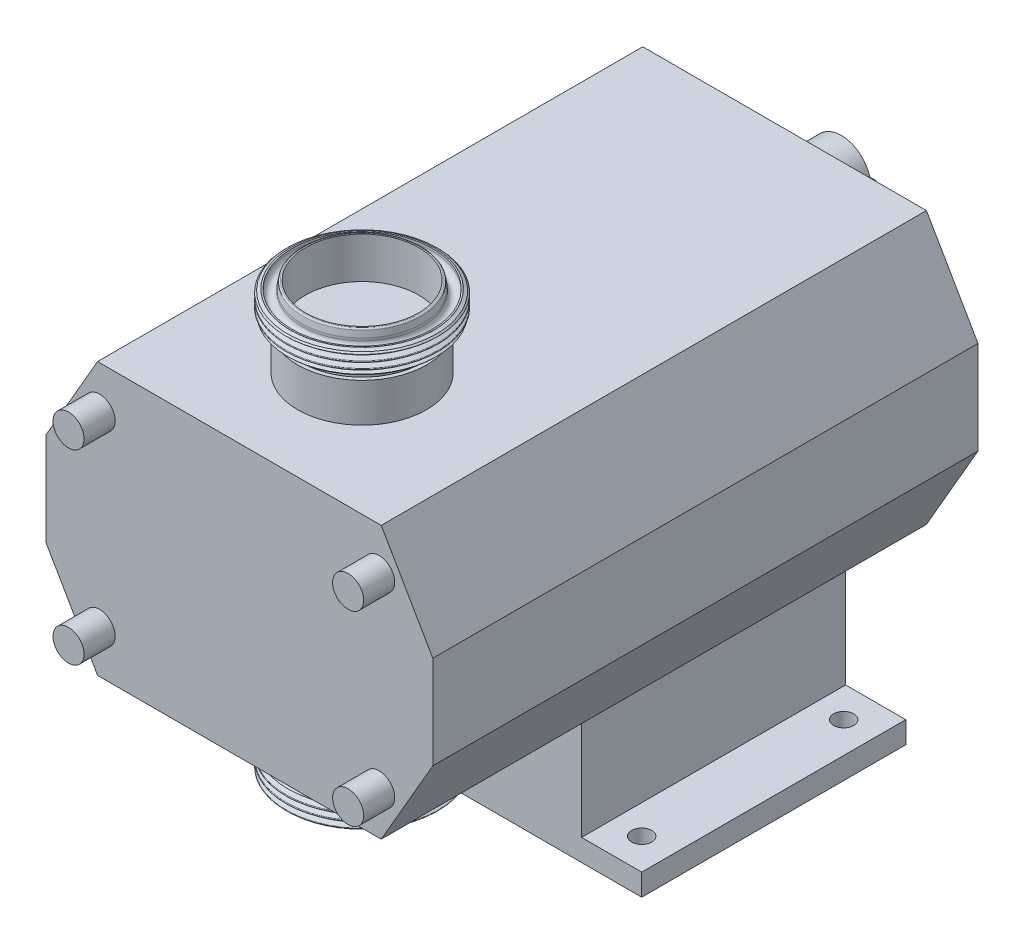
ISO-10303-21;
HEADER;
FILE_DESCRIPTION(('STEP AP214'),'2;1');
FILE_NAME('part.step','',(''),(''),'','','');
FILE_SCHEMA(('AUTOMOTIVE_DESIGN { 1 0 10303 214 1 1 1 1 }'));
ENDSEC;
DATA;
#1=APPLICATION_CONTEXT('core data for automotive mechanical design processes');
#2=APPLICATION_PROTOCOL_DEFINITION('international standard','automotive_design',2000,#1);
#3=PRODUCT_CONTEXT('',#1,'mechanical');
#4=PRODUCT('Part','Part','',(#3));
#5=PRODUCT_RELATED_PRODUCT_CATEGORY('part','',(#4));
#6=PRODUCT_DEFINITION_FORMATION('','',#4);
#7=PRODUCT_DEFINITION_CONTEXT('part definition',#1,'design');
#8=PRODUCT_DEFINITION('design','',#6,#7);
#9=PRODUCT_DEFINITION_SHAPE('','',#8);
#10=(LENGTH_UNIT() NAMED_UNIT(*) SI_UNIT(.MILLI.,.METRE.));
#11=(NAMED_UNIT(*) PLANE_ANGLE_UNIT() SI_UNIT($,.RADIAN.));
#12=(NAMED_UNIT(*) SI_UNIT($,.STERADIAN.) SOLID_ANGLE_UNIT());
#13=UNCERTAINTY_MEASURE_WITH_UNIT(LENGTH_MEASURE(1.E-05),#10,'distance_accuracy_value','');
#14=(GEOMETRIC_REPRESENTATION_CONTEXT(3) GLOBAL_UNCERTAINTY_ASSIGNED_CONTEXT((#13)) GLOBAL_UNIT_ASSIGNED_CONTEXT((#10,
#11,#12)) REPRESENTATION_CONTEXT('',''));
#15=CARTESIAN_POINT('',(0.,0.,0.));
#16=DIRECTION('',(0.,0.,1.));
#17=DIRECTION('',(1.,0.,0.));
#18=AXIS2_PLACEMENT_3D('',#15,#16,#17);
#19=CARTESIAN_POINT('',(-47.7594583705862,18.4261984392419,139.232657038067));
#20=DIRECTION('',(0.,0.,1.));
#21=DIRECTION('',(1.,0.,0.));
#22=AXIS2_PLACEMENT_3D('',#19,#20,#21);
#23=CYLINDRICAL_SURFACE('',#22,19.);
#24=CARTESIAN_POINT('',(-47.7594583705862,18.4261984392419,-105.5));
#25=DIRECTION('',(0.,0.,1.));
#26=DIRECTION('',(1.,0.,0.));
#27=AXIS2_PLACEMENT_3D('',#24,#25,#26);
#28=CIRCLE('',#27,19.);
#29=CARTESIAN_POINT('',(-28.7594583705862,18.4261984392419,-105.5));
#30=VERTEX_POINT('',#29);
#31=EDGE_CURVE('P0_E277',#30,#30,#28,.T.);
#32=ORIENTED_EDGE('',*,*,#31,.F.);
#33=EDGE_LOOP('',(#32));
#34=FACE_BOUND('',#33,.T.);
#35=DIRECTION('',(0.,0.,1.));
#36=VECTOR('',#35,1.);
#37=CARTESIAN_POINT('',(-29.4291555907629,23.4261984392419,139.232657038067));
#38=LINE('',#37,#36);
#39=CARTESIAN_POINT('',(-29.4291555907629,23.4261984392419,-185.5));
#40=VERTEX_POINT('',#39);
#41=CARTESIAN_POINT('',(-29.4291555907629,23.4261984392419,-145.5));
#42=VERTEX_POINT('',#41);
#43=EDGE_CURVE('P0_E178',#40,#42,#38,.T.);
#44=ORIENTED_EDGE('',*,*,#43,.F.);
#45=CARTESIAN_POINT('',(-47.7594583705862,18.4261984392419,-185.5));
#46=DIRECTION('',(0.,0.,1.));
#47=DIRECTION('',(1.,0.,0.));
#48=AXIS2_PLACEMENT_3D('',#45,#46,#47);
#49=CIRCLE('',#48,19.);
#50=CARTESIAN_POINT('',(-29.4291555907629,13.4261984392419,-185.5));
#51=VERTEX_POINT('',#50);
#52=EDGE_CURVE('P0_E176',#40,#51,#49,.T.);
#53=ORIENTED_EDGE('',*,*,#52,.T.);
#54=DIRECTION('',(0.,0.,1.));
#55=VECTOR('',#54,1.);
#56=CARTESIAN_POINT('',(-29.4291555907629,13.4261984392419,139.232657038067));
#57=LINE('',#56,#55);
#58=CARTESIAN_POINT('',(-29.4291555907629,13.4261984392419,-145.5));
#59=VERTEX_POINT('',#58);
#60=EDGE_CURVE('P0_E39',#59,#51,#57,.F.);
#61=ORIENTED_EDGE('',*,*,#60,.F.);
#62=CARTESIAN_POINT('',(-28.7594583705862,18.4261984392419,-150.5));
#63=CARTESIAN_POINT('',(-28.7594626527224,18.7019677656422,-150.499993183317));
#64=CARTESIAN_POINT('',(-28.7655214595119,18.977810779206,-150.477108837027));
#65=CARTESIAN_POINT('',(-28.7891031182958,19.52155928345,-150.386332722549));
#66=CARTESIAN_POINT('',(-28.8066316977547,19.7894607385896,-150.31841846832));
#67=CARTESIAN_POINT('',(-28.8512168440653,20.3093980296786,-150.139936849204));
#68=CARTESIAN_POINT('',(-28.8782613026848,20.5614535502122,-150.029423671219));
#69=CARTESIAN_POINT('',(-28.9390153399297,21.0434514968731,-149.769079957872));
#70=CARTESIAN_POINT('',(-28.972725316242,21.2733926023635,-149.619247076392));
#71=CARTESIAN_POINT('',(-29.0440195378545,21.7098383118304,-149.280936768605));
#72=CARTESIAN_POINT('',(-29.0816686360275,21.915771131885,-149.091735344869));
#73=CARTESIAN_POINT('',(-29.1561783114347,22.2933801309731,-148.681606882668));
#74=CARTESIAN_POINT('',(-29.1930387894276,22.465052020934,-148.460675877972));
#75=CARTESIAN_POINT('',(-29.2624590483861,22.7720326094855,-147.988822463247));
#76=CARTESIAN_POINT('',(-29.2949368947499,22.9066874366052,-147.737461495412));
#77=CARTESIAN_POINT('',(-29.3509627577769,23.1316013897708,-147.214675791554));
#78=CARTESIAN_POINT('',(-29.3745123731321,23.2218684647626,-146.943254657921));
#79=CARTESIAN_POINT('',(-29.4093464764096,23.353466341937,-146.394376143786));
#80=CARTESIAN_POINT('',(-29.4208898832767,23.3958319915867,-146.117183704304));
#81=CARTESIAN_POINT('',(-29.4311784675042,23.4336500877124,-145.559403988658));
#82=CARTESIAN_POINT('',(-29.4299259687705,23.4291110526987,-145.278817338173));
#83=CARTESIAN_POINT('',(-29.4149962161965,23.3740710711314,-144.730259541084));
#84=CARTESIAN_POINT('',(-29.4016563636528,23.3248181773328,-144.462152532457));
#85=CARTESIAN_POINT('',(-29.3645946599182,23.1837457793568,-143.938147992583));
#86=CARTESIAN_POINT('',(-29.3408719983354,23.0919229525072,-143.682251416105));
#87=CARTESIAN_POINT('',(-29.2854181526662,22.8672902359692,-143.18665842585));
#88=CARTESIAN_POINT('',(-29.253601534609,22.7340395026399,-142.947171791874));
#89=CARTESIAN_POINT('',(-29.1855911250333,22.4306411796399,-142.493517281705));
#90=CARTESIAN_POINT('',(-29.1493964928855,22.2604864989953,-142.279354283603));
#91=CARTESIAN_POINT('',(-29.0753003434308,21.8817109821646,-141.875291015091));
#92=CARTESIAN_POINT('',(-29.037381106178,21.6720409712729,-141.686376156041));
#93=CARTESIAN_POINT('',(-28.9651393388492,21.2235346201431,-141.346190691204));
#94=CARTESIAN_POINT('',(-28.9308169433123,20.9846971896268,-141.194921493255));
#95=CARTESIAN_POINT('',(-28.8694339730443,20.4831356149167,-140.933903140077));
#96=CARTESIAN_POINT('',(-28.8424040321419,20.2203167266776,-140.824328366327));
#97=CARTESIAN_POINT('',(-28.7988731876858,19.6791154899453,-140.651199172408));
#98=CARTESIAN_POINT('',(-28.7823700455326,19.4007364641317,-140.587634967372));
#99=CARTESIAN_POINT('',(-28.7620892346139,18.844730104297,-140.509869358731));
#100=CARTESIAN_POINT('',(-28.7579661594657,18.5673025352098,-140.494327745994));
#101=CARTESIAN_POINT('',(-28.7619189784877,18.0138062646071,-140.509352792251));
#102=CARTESIAN_POINT('',(-28.7699936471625,17.7377374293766,-140.539914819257));
#103=CARTESIAN_POINT('',(-28.7972119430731,17.1995514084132,-140.645179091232));
#104=CARTESIAN_POINT('',(-28.8161688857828,16.9372783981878,-140.71913734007));
#105=CARTESIAN_POINT('',(-28.863004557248,16.4288845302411,-140.908233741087));
#106=CARTESIAN_POINT('',(-28.89088423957,16.1827654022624,-141.023376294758));
#107=CARTESIAN_POINT('',(-28.9532861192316,15.7084312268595,-141.294082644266));
#108=CARTESIAN_POINT('',(-28.9879255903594,15.480650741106,-141.450380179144));
#109=CARTESIAN_POINT('',(-29.0598411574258,15.0540789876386,-141.798034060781));
#110=CARTESIAN_POINT('',(-29.0971177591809,14.8552933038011,-141.989397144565));
#111=CARTESIAN_POINT('',(-29.1713712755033,14.4867330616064,-142.407998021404));
#112=CARTESIAN_POINT('',(-29.2083119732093,14.3179029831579,-142.636075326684));
#113=CARTESIAN_POINT('',(-29.2765843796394,14.0208968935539,-143.118100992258));
#114=CARTESIAN_POINT('',(-29.3079163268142,13.8927191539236,-143.372048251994));
#115=CARTESIAN_POINT('',(-29.361066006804,13.6816211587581,-143.89731246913));
#116=CARTESIAN_POINT('',(-29.3829391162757,13.5984367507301,-144.168517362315));
#117=CARTESIAN_POINT('',(-29.414716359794,13.4790447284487,-144.72173645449));
#118=CARTESIAN_POINT('',(-29.4246234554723,13.4428254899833,-145.00374796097));
#119=CARTESIAN_POINT('',(-29.4311041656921,13.4190476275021,-145.560918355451));
#120=CARTESIAN_POINT('',(-29.4280932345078,13.4299728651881,-145.836008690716));
#121=CARTESIAN_POINT('',(-29.4100472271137,13.4966670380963,-146.380276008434));
#122=CARTESIAN_POINT('',(-29.3950124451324,13.5524348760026,-146.649453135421));
#123=CARTESIAN_POINT('',(-29.3548567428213,13.7063629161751,-147.172400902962));
#124=CARTESIAN_POINT('',(-29.3298104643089,13.8042097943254,-147.426269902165));
#125=CARTESIAN_POINT('',(-29.2724502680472,14.0392743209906,-147.914178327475));
#126=CARTESIAN_POINT('',(-29.2401352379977,14.1764979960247,-148.148214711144));
#127=CARTESIAN_POINT('',(-29.1707195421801,14.491049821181,-148.597070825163));
#128=CARTESIAN_POINT('',(-29.1335081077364,14.6694163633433,-148.811145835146));
#129=CARTESIAN_POINT('',(-29.0591199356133,15.059205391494,-149.206818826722));
#130=CARTESIAN_POINT('',(-29.0219432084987,15.2706358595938,-149.388408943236));
#131=CARTESIAN_POINT('',(-28.9508948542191,15.7258242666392,-149.717640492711));
#132=CARTESIAN_POINT('',(-28.9171074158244,15.970160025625,-149.86450271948));
#133=CARTESIAN_POINT('',(-28.8575580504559,16.4809306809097,-150.114834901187));
#134=CARTESIAN_POINT('',(-28.8317908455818,16.7473508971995,-150.218333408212));
#135=CARTESIAN_POINT('',(-28.7946209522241,17.2484468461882,-150.365096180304));
#136=CARTESIAN_POINT('',(-28.7815298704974,17.480911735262,-150.415569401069));
#137=CARTESIAN_POINT('',(-28.7639471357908,17.950965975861,-150.483022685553));
#138=CARTESIAN_POINT('',(-28.7594546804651,18.1885548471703,-150.500005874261));
#139=CARTESIAN_POINT('',(-28.7594583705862,18.4261984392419,-150.5));
#140=B_SPLINE_CURVE_WITH_KNOTS('',3,(#62,#63,#64,#65,#66,#67,#68,#69,#70,#71,#72,#73,#74,#75,
#76,#77,#78,#79,#80,#81,#82,#83,#84,#85,#86,#87,#88,#89,#90,#91,#92,#93,#94,#95,#96,#97,#98,#99,
#100,#101,#102,#103,#104,#105,#106,#107,#108,#109,#110,#111,#112,#113,#114,#115,#116,#117,#118,
#119,#120,#121,#122,#123,#124,#125,#126,#127,#128,#129,#130,#131,#132,#133,#134,#135,#136,#137,
#138,#139),.UNSPECIFIED.,.T.,.F.,(4,2,2,2,2,2,2,2,2,2,2,2,2,2,2,2,2,2,2,2,2,2,2,2,2,2,2,2,2,2,2,
2,2,2,2,2,2,2,4),(0.,0.826436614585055,1.65328622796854,2.47908752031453,3.30493809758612,
4.14758534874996,4.99033802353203,5.84713921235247,6.70378690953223,7.5415514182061,
8.37916378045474,9.19409222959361,10.0090842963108,10.8330642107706,11.6572025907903,
12.5074895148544,13.35780823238,14.2116451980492,15.0653005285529,15.8949065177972,
16.7244291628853,17.5401294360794,18.3559169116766,19.187369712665,20.0189824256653,
20.8733883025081,21.7277578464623,22.577055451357,23.4261428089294,24.2481310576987,
25.0700991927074,25.8860500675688,26.702125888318,27.5416338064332,28.3813447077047,
29.2384104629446,30.0949110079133,30.8071573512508,31.5193372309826),.UNSPECIFIED.);
#141=EDGE_CURVE('P0_E11',#42,#59,#140,.T.);
#142=ORIENTED_EDGE('',*,*,#141,.F.);
#143=EDGE_LOOP('',(#44,#53,#61,#142));
#144=FACE_BOUND('',#143,.T.);
#145=ADVANCED_FACE('P0_F17',(#34,#144),#23,.T.);
#146=CARTESIAN_POINT('',(-92.5618178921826,-69.0738015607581,248.5));
#147=DIRECTION('',(0.,1.,0.));
#148=DIRECTION('',(-1.,0.,0.));
#149=AXIS2_PLACEMENT_3D('',#146,#147,#148);
#150=PLANE('',#149);
#151=CARTESIAN_POINT('',(-1.2594583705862,-69.0738015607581,169.5));
#152=DIRECTION('',(0.,1.,0.));
#153=DIRECTION('',(-1.,0.,0.));
#154=AXIS2_PLACEMENT_3D('',#151,#152,#153);
#155=CIRCLE('',#154,41.5);
#156=CARTESIAN_POINT('',(-42.7594583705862,-69.0738015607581,169.5));
#157=VERTEX_POINT('',#156);
#158=EDGE_CURVE('P0_E192',#157,#157,#155,.T.);
#159=ORIENTED_EDGE('',*,*,#158,.T.);
#160=EDGE_LOOP('',(#159));
#161=FACE_BOUND('',#160,.T.);
#162=DIRECTION('',(1.,0.,0.));
#163=VECTOR('',#162,1.);
#164=CARTESIAN_POINT('',(-92.5618178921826,-69.0738015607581,-102.5));
#165=LINE('',#164,#163);
#166=CARTESIAN_POINT('',(-92.5618178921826,-69.0738015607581,-102.5));
#167=VERTEX_POINT('',#166);
#168=CARTESIAN_POINT('',(90.0429011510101,-69.0738015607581,-102.5));
#169=VERTEX_POINT('',#168);
#170=EDGE_CURVE('P0_E328',#167,#169,#165,.T.);
#171=ORIENTED_EDGE('',*,*,#170,.T.);
#172=DIRECTION('',(0.,0.,-1.));
#173=VECTOR('',#172,1.);
#174=CARTESIAN_POINT('',(90.0429011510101,-69.0738015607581,248.5));
#175=LINE('',#174,#173);
#176=CARTESIAN_POINT('',(90.0429011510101,-69.0738015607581,248.5));
#177=VERTEX_POINT('',#176);
#178=EDGE_CURVE('P0_E338',#177,#169,#175,.T.);
#179=ORIENTED_EDGE('',*,*,#178,.F.);
#180=DIRECTION('',(1.,0.,0.));
#181=VECTOR('',#180,1.);
#182=CARTESIAN_POINT('',(-92.5618178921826,-69.0738015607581,248.5));
#183=LINE('',#182,#181);
#184=CARTESIAN_POINT('',(-92.5618178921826,-69.0738015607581,248.5));
#185=VERTEX_POINT('',#184);
#186=EDGE_CURVE('P0_E311',#185,#177,#183,.T.);
#187=ORIENTED_EDGE('',*,*,#186,.F.);
#188=DIRECTION('',(0.,0.,-1.));
#189=VECTOR('',#188,1.);
#190=CARTESIAN_POINT('',(-92.5618178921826,-69.0738015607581,248.5));
#191=LINE('',#190,#189);
#192=EDGE_CURVE('P0_E341',#185,#167,#191,.T.);
#193=ORIENTED_EDGE('',*,*,#192,.T.);
#194=EDGE_LOOP('',(#171,#179,#187,#193));
#195=FACE_BOUND('',#194,.T.);
#196=DIRECTION('',(1.,0.,0.));
#197=VECTOR('',#196,1.);
#198=CARTESIAN_POINT('',(65.0429011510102,-69.0738015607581,-75.5));
#199=LINE('',#198,#197);
#200=CARTESIAN_POINT('',(-67.5618178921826,-69.0738015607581,-75.5));
#201=VERTEX_POINT('',#200);
#202=CARTESIAN_POINT('',(65.0429011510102,-69.0738015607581,-75.5));
#203=VERTEX_POINT('',#202);
#204=EDGE_CURVE('P0_E220',#201,#203,#199,.T.);
#205=ORIENTED_EDGE('',*,*,#204,.F.);
#206=DIRECTION('',(0.,0.,1.));
#207=VECTOR('',#206,1.);
#208=CARTESIAN_POINT('',(-67.5618178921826,-69.0738015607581,-75.5));
#209=LINE('',#208,#207);
#210=CARTESIAN_POINT('',(-67.5618178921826,-69.0738015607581,94.5));
#211=VERTEX_POINT('',#210);
#212=EDGE_CURVE('P0_E238',#201,#211,#209,.T.);
#213=ORIENTED_EDGE('',*,*,#212,.T.);
#214=DIRECTION('',(1.,0.,0.));
#215=VECTOR('',#214,1.);
#216=CARTESIAN_POINT('',(65.0429011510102,-69.0738015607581,94.5));
#217=LINE('',#216,#215);
#218=CARTESIAN_POINT('',(65.0429011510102,-69.0738015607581,94.5));
#219=VERTEX_POINT('',#218);
#220=EDGE_CURVE('P0_E219',#211,#219,#217,.T.);
#221=ORIENTED_EDGE('',*,*,#220,.T.);
#222=DIRECTION('',(0.,0.,1.));
#223=VECTOR('',#222,1.);
#224=CARTESIAN_POINT('',(65.0429011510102,-69.0738015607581,-75.5));
#225=LINE('',#224,#223);
#226=EDGE_CURVE('P0_E274',#203,#219,#225,.T.);
#227=ORIENTED_EDGE('',*,*,#226,.F.);
#228=EDGE_LOOP('',(#205,#213,#221,#227));
#229=FACE_BOUND('',#228,.T.);
#230=ADVANCED_FACE('P0_F392',(#161,#195,#229),#150,.F.);
#231=CARTESIAN_POINT('',(-1.25945837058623,264.066523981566,-102.5));
#232=DIRECTION('',(0.,0.,-1.));
#233=DIRECTION('',(-1.,0.,0.));
#234=AXIS2_PLACEMENT_3D('',#231,#232,#233);
#235=PLANE('',#234);
#236=DIRECTION('',(-0.500000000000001,0.866025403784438,0.));
#237=VECTOR('',#236,1.);
#238=CARTESIAN_POINT('',(90.0429011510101,105.926198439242,-102.5));
#239=LINE('',#238,#237);
#240=CARTESIAN_POINT('',(123.240541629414,48.4261984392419,-102.5));
#241=VERTEX_POINT('',#240);
#242=CARTESIAN_POINT('',(90.0429011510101,105.926198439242,-102.5));
#243=VERTEX_POINT('',#242);
#244=EDGE_CURVE('P0_E298',#241,#243,#239,.T.);
#245=ORIENTED_EDGE('',*,*,#244,.F.);
#246=DIRECTION('',(0.,1.,0.));
#247=VECTOR('',#246,1.);
#248=CARTESIAN_POINT('',(123.240541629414,48.4261984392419,-102.5));
#249=LINE('',#248,#247);
#250=CARTESIAN_POINT('',(123.240541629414,-11.5738015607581,-102.5));
#251=VERTEX_POINT('',#250);
#252=EDGE_CURVE('P0_E303',#251,#241,#249,.T.);
#253=ORIENTED_EDGE('',*,*,#252,.F.);
#254=DIRECTION('',(0.500000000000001,0.866025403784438,0.));
#255=VECTOR('',#254,1.);
#256=CARTESIAN_POINT('',(90.0429011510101,-69.0738015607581,-102.5));
#257=LINE('',#256,#255);
#258=EDGE_CURVE('P0_E330',#169,#251,#257,.T.);
#259=ORIENTED_EDGE('',*,*,#258,.F.);
#260=ORIENTED_EDGE('',*,*,#170,.F.);
#261=DIRECTION('',(0.500000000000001,-0.866025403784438,0.));
#262=VECTOR('',#261,1.);
#263=CARTESIAN_POINT('',(-92.5618178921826,-69.0738015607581,-102.5));
#264=LINE('',#263,#262);
#265=CARTESIAN_POINT('',(-125.759458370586,-11.5738015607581,-102.5));
#266=VERTEX_POINT('',#265);
#267=EDGE_CURVE('P0_E326',#266,#167,#264,.T.);
#268=ORIENTED_EDGE('',*,*,#267,.F.);
#269=DIRECTION('',(0.,-1.,0.));
#270=VECTOR('',#269,1.);
#271=CARTESIAN_POINT('',(-125.759458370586,48.4261984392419,-102.5));
#272=LINE('',#271,#270);
#273=CARTESIAN_POINT('',(-125.759458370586,48.4261984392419,-102.5));
#274=VERTEX_POINT('',#273);
#275=EDGE_CURVE('P0_E324',#274,#266,#272,.T.);
#276=ORIENTED_EDGE('',*,*,#275,.F.);
#277=DIRECTION('',(-0.500000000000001,-0.866025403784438,0.));
#278=VECTOR('',#277,1.);
#279=CARTESIAN_POINT('',(-92.5618178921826,105.926198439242,-102.5));
#280=LINE('',#279,#278);
#281=CARTESIAN_POINT('',(-92.5618178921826,105.926198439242,-102.5));
#282=VERTEX_POINT('',#281);
#283=EDGE_CURVE('P0_E322',#282,#274,#280,.T.);
#284=ORIENTED_EDGE('',*,*,#283,.F.);
#285=DIRECTION('',(-1.,0.,0.));
#286=VECTOR('',#285,1.);
#287=CARTESIAN_POINT('',(-92.5618178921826,105.926198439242,-102.5));
#288=LINE('',#287,#286);
#289=EDGE_CURVE('P0_E320',#243,#282,#288,.T.);
#290=ORIENTED_EDGE('',*,*,#289,.F.);
#291=EDGE_LOOP('',(#245,#253,#259,#260,#268,#276,#284,#290));
#292=FACE_BOUND('',#291,.T.);
#293=CARTESIAN_POINT('',(-47.7594583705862,18.4261984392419,-102.5));
#294=DIRECTION('',(0.,0.,1.));
#295=DIRECTION('',(1.,0.,0.));
#296=AXIS2_PLACEMENT_3D('',#293,#294,#295);
#297=CIRCLE('',#296,22.);
#298=CARTESIAN_POINT('',(-25.7594583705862,18.4261984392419,-102.5));
#299=VERTEX_POINT('',#298);
#300=EDGE_CURVE('P0_E283',#299,#299,#297,.T.);
#301=ORIENTED_EDGE('',*,*,#300,.T.);
#302=EDGE_LOOP('',(#301));
#303=FACE_BOUND('',#302,.T.);
#304=ADVANCED_FACE('P0_F397',(#292,#303),#235,.T.);
#305=CARTESIAN_POINT('',(-1.25945837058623,264.066523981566,248.5));
#306=DIRECTION('',(0.,0.,-1.));
#307=DIRECTION('',(-1.,0.,0.));
#308=AXIS2_PLACEMENT_3D('',#305,#306,#307);
#309=PLANE('',#308);
#310=CARTESIAN_POINT('',(88.7405416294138,-41.573801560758,248.5));
#311=DIRECTION('',(0.,0.,-1.));
#312=DIRECTION('',(-1.,0.,0.));
#313=AXIS2_PLACEMENT_3D('',#310,#311,#312);
#314=CIRCLE('',#313,9.99999999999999);
#315=CARTESIAN_POINT('',(78.7405416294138,-41.573801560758,248.5));
#316=VERTEX_POINT('',#315);
#317=EDGE_CURVE('P0_E362',#316,#316,#314,.F.);
#318=ORIENTED_EDGE('',*,*,#317,.F.);
#319=EDGE_LOOP('',(#318));
#320=FACE_BOUND('',#319,.T.);
#321=CARTESIAN_POINT('',(-91.2594583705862,78.4261984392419,248.5));
#322=DIRECTION('',(0.,0.,-1.));
#323=DIRECTION('',(-1.,0.,0.));
#324=AXIS2_PLACEMENT_3D('',#321,#322,#323);
#325=CIRCLE('',#324,9.99999999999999);
#326=CARTESIAN_POINT('',(-101.259458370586,78.4261984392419,248.5));
#327=VERTEX_POINT('',#326);
#328=EDGE_CURVE('P0_E356',#327,#327,#325,.F.);
#329=ORIENTED_EDGE('',*,*,#328,.F.);
#330=EDGE_LOOP('',(#329));
#331=FACE_BOUND('',#330,.T.);
#332=DIRECTION('',(-0.500000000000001,0.866025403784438,0.));
#333=VECTOR('',#332,1.);
#334=CARTESIAN_POINT('',(90.0429011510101,105.926198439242,248.5));
#335=LINE('',#334,#333);
#336=CARTESIAN_POINT('',(123.240541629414,48.4261984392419,248.5));
#337=VERTEX_POINT('',#336);
#338=CARTESIAN_POINT('',(90.0429011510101,105.926198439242,248.5));
#339=VERTEX_POINT('',#338);
#340=EDGE_CURVE('P0_E299',#337,#339,#335,.T.);
#341=ORIENTED_EDGE('',*,*,#340,.T.);
#342=DIRECTION('',(-1.,0.,0.));
#343=VECTOR('',#342,1.);
#344=CARTESIAN_POINT('',(-92.5618178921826,105.926198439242,248.5));
#345=LINE('',#344,#343);
#346=CARTESIAN_POINT('',(-92.5618178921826,105.926198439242,248.5));
#347=VERTEX_POINT('',#346);
#348=EDGE_CURVE('P0_E302',#339,#347,#345,.T.);
#349=ORIENTED_EDGE('',*,*,#348,.T.);
#350=DIRECTION('',(-0.500000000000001,-0.866025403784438,0.));
#351=VECTOR('',#350,1.);
#352=CARTESIAN_POINT('',(-92.5618178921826,105.926198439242,248.5));
#353=LINE('',#352,#351);
#354=CARTESIAN_POINT('',(-125.759458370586,48.4261984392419,248.5));
#355=VERTEX_POINT('',#354);
#356=EDGE_CURVE('P0_E305',#347,#355,#353,.T.);
#357=ORIENTED_EDGE('',*,*,#356,.T.);
#358=DIRECTION('',(0.,-1.,0.));
#359=VECTOR('',#358,1.);
#360=CARTESIAN_POINT('',(-125.759458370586,48.4261984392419,248.5));
#361=LINE('',#360,#359);
#362=CARTESIAN_POINT('',(-125.759458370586,-11.5738015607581,248.5));
#363=VERTEX_POINT('',#362);
#364=EDGE_CURVE('P0_E307',#355,#363,#361,.T.);
#365=ORIENTED_EDGE('',*,*,#364,.T.);
#366=DIRECTION('',(0.500000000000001,-0.866025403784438,0.));
#367=VECTOR('',#366,1.);
#368=CARTESIAN_POINT('',(-92.5618178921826,-69.0738015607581,248.5));
#369=LINE('',#368,#367);
#370=EDGE_CURVE('P0_E309',#363,#185,#369,.T.);
#371=ORIENTED_EDGE('',*,*,#370,.T.);
#372=ORIENTED_EDGE('',*,*,#186,.T.);
#373=DIRECTION('',(0.500000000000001,0.866025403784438,0.));
#374=VECTOR('',#373,1.);
#375=CARTESIAN_POINT('',(90.0429011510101,-69.0738015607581,248.5));
#376=LINE('',#375,#374);
#377=CARTESIAN_POINT('',(123.240541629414,-11.5738015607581,248.5));
#378=VERTEX_POINT('',#377);
#379=EDGE_CURVE('P0_E313',#177,#378,#376,.T.);
#380=ORIENTED_EDGE('',*,*,#379,.T.);
#381=DIRECTION('',(0.,1.,0.));
#382=VECTOR('',#381,1.);
#383=CARTESIAN_POINT('',(123.240541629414,48.4261984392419,248.5));
#384=LINE('',#383,#382);
#385=EDGE_CURVE('P0_E315',#378,#337,#384,.T.);
#386=ORIENTED_EDGE('',*,*,#385,.T.);
#387=EDGE_LOOP('',(#341,#349,#357,#365,#371,#372,#380,#386));
#388=FACE_BOUND('',#387,.T.);
#389=CARTESIAN_POINT('',(88.7405416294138,78.4261984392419,248.5));
#390=DIRECTION('',(0.,0.,-1.));
#391=DIRECTION('',(-1.,0.,0.));
#392=AXIS2_PLACEMENT_3D('',#389,#390,#391);
#393=CIRCLE('',#392,9.99999999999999);
#394=CARTESIAN_POINT('',(78.7405416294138,78.4261984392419,248.5));
#395=VERTEX_POINT('',#394);
#396=EDGE_CURVE('P0_E359',#395,#395,#393,.F.);
#397=ORIENTED_EDGE('',*,*,#396,.F.);
#398=EDGE_LOOP('',(#397));
#399=FACE_BOUND('',#398,.T.);
#400=CARTESIAN_POINT('',(-91.2594583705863,-41.5738015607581,248.5));
#401=DIRECTION('',(0.,0.,-1.));
#402=DIRECTION('',(-1.,0.,0.));
#403=AXIS2_PLACEMENT_3D('',#400,#401,#402);
#404=CIRCLE('',#403,9.99999999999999);
#405=CARTESIAN_POINT('',(-101.259458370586,-41.5738015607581,248.5));
#406=VERTEX_POINT('',#405);
#407=EDGE_CURVE('P0_E29',#406,#406,#404,.F.);
#408=ORIENTED_EDGE('',*,*,#407,.F.);
#409=EDGE_LOOP('',(#408));
#410=FACE_BOUND('',#409,.T.);
#411=ADVANCED_FACE('P0_F446',(#320,#331,#388,#399,#410),#309,.F.);
#412=CARTESIAN_POINT('',(90.0429011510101,105.926198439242,248.5));
#413=DIRECTION('',(-0.866025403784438,-0.500000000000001,0.));
#414=DIRECTION('',(0.500000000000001,-0.866025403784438,0.));
#415=AXIS2_PLACEMENT_3D('',#412,#413,#414);
#416=PLANE('',#415);
#417=ORIENTED_EDGE('',*,*,#244,.T.);
#418=DIRECTION('',(0.,0.,-1.));
#419=VECTOR('',#418,1.);
#420=CARTESIAN_POINT('',(90.0429011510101,105.926198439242,248.5));
#421=LINE('',#420,#419);
#422=EDGE_CURVE('P0_E353',#339,#243,#421,.T.);
#423=ORIENTED_EDGE('',*,*,#422,.F.);
#424=ORIENTED_EDGE('',*,*,#340,.F.);
#425=DIRECTION('',(0.,0.,-1.));
#426=VECTOR('',#425,1.);
#427=CARTESIAN_POINT('',(123.240541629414,48.4261984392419,248.5));
#428=LINE('',#427,#426);
#429=EDGE_CURVE('P0_E317',#337,#241,#428,.T.);
#430=ORIENTED_EDGE('',*,*,#429,.T.);
#431=EDGE_LOOP('',(#417,#423,#424,#430));
#432=FACE_BOUND('',#431,.T.);
#433=ADVANCED_FACE('P0_F19',(#432),#416,.F.);
#434=CARTESIAN_POINT('',(-92.5618178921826,105.926198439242,248.5));
#435=DIRECTION('',(0.,-1.,0.));
#436=DIRECTION('',(1.,0.,0.));
#437=AXIS2_PLACEMENT_3D('',#434,#435,#436);
#438=PLANE('',#437);
#439=CARTESIAN_POINT('',(-1.2594583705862,105.926198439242,169.5));
#440=DIRECTION('',(0.,-1.,0.));
#441=DIRECTION('',(1.,0.,0.));
#442=AXIS2_PLACEMENT_3D('',#439,#440,#441);
#443=CIRCLE('',#442,41.5);
#444=CARTESIAN_POINT('',(40.2405416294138,105.926198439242,169.5));
#445=VERTEX_POINT('',#444);
#446=EDGE_CURVE('P0_E191',#445,#445,#443,.T.);
#447=ORIENTED_EDGE('',*,*,#446,.T.);
#448=EDGE_LOOP('',(#447));
#449=FACE_BOUND('',#448,.T.);
#450=ORIENTED_EDGE('',*,*,#289,.T.);
#451=DIRECTION('',(0.,0.,-1.));
#452=VECTOR('',#451,1.);
#453=CARTESIAN_POINT('',(-92.5618178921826,105.926198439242,248.5));
#454=LINE('',#453,#452);
#455=EDGE_CURVE('P0_E350',#347,#282,#454,.T.);
#456=ORIENTED_EDGE('',*,*,#455,.F.);
#457=ORIENTED_EDGE('',*,*,#348,.F.);
#458=ORIENTED_EDGE('',*,*,#422,.T.);
#459=EDGE_LOOP('',(#450,#456,#457,#458));
#460=FACE_BOUND('',#459,.T.);
#461=ADVANCED_FACE('P0_F369',(#449,#460),#438,.F.);
#462=CARTESIAN_POINT('',(-92.5618178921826,105.926198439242,248.5));
#463=DIRECTION('',(0.866025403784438,-0.500000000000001,0.));
#464=DIRECTION('',(0.500000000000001,0.866025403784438,0.));
#465=AXIS2_PLACEMENT_3D('',#462,#463,#464);
#466=PLANE('',#465);
#467=ORIENTED_EDGE('',*,*,#283,.T.);
#468=DIRECTION('',(0.,0.,-1.));
#469=VECTOR('',#468,1.);
#470=CARTESIAN_POINT('',(-125.759458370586,48.4261984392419,248.5));
#471=LINE('',#470,#469);
#472=EDGE_CURVE('P0_E347',#355,#274,#471,.T.);
#473=ORIENTED_EDGE('',*,*,#472,.F.);
#474=ORIENTED_EDGE('',*,*,#356,.F.);
#475=ORIENTED_EDGE('',*,*,#455,.T.);
#476=EDGE_LOOP('',(#467,#473,#474,#475));
#477=FACE_BOUND('',#476,.T.);
#478=ADVANCED_FACE('P0_F467',(#477),#466,.F.);
#479=CARTESIAN_POINT('',(-125.759458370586,48.4261984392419,248.5));
#480=DIRECTION('',(1.,0.,0.));
#481=DIRECTION('',(0.,0.,-1.));
#482=AXIS2_PLACEMENT_3D('',#479,#480,#481);
#483=PLANE('',#482);
#484=ORIENTED_EDGE('',*,*,#275,.T.);
#485=DIRECTION('',(0.,0.,-1.));
#486=VECTOR('',#485,1.);
#487=CARTESIAN_POINT('',(-125.759458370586,-11.5738015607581,248.5));
#488=LINE('',#487,#486);
#489=EDGE_CURVE('P0_E344',#363,#266,#488,.T.);
#490=ORIENTED_EDGE('',*,*,#489,.F.);
#491=ORIENTED_EDGE('',*,*,#364,.F.);
#492=ORIENTED_EDGE('',*,*,#472,.T.);
#493=EDGE_LOOP('',(#484,#490,#491,#492));
#494=FACE_BOUND('',#493,.T.);
#495=ADVANCED_FACE('P0_F463',(#494),#483,.F.);
#496=CARTESIAN_POINT('',(-92.5618178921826,-69.0738015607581,248.5));
#497=DIRECTION('',(0.866025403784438,0.500000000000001,0.));
#498=DIRECTION('',(-0.500000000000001,0.866025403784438,0.));
#499=AXIS2_PLACEMENT_3D('',#496,#497,#498);
#500=PLANE('',#499);
#501=ORIENTED_EDGE('',*,*,#267,.T.);
#502=ORIENTED_EDGE('',*,*,#192,.F.);
#503=ORIENTED_EDGE('',*,*,#370,.F.);
#504=ORIENTED_EDGE('',*,*,#489,.T.);
#505=EDGE_LOOP('',(#501,#502,#503,#504));
#506=FACE_BOUND('',#505,.T.);
#507=ADVANCED_FACE('P0_F458',(#506),#500,.F.);
#508=CARTESIAN_POINT('',(90.0429011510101,-69.0738015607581,248.5));
#509=DIRECTION('',(-0.866025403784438,0.500000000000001,0.));
#510=DIRECTION('',(-0.500000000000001,-0.866025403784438,0.));
#511=AXIS2_PLACEMENT_3D('',#508,#509,#510);
#512=PLANE('',#511);
#513=ORIENTED_EDGE('',*,*,#258,.T.);
#514=DIRECTION('',(0.,0.,-1.));
#515=VECTOR('',#514,1.);
#516=CARTESIAN_POINT('',(123.240541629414,-11.5738015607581,248.5));
#517=LINE('',#516,#515);
#518=EDGE_CURVE('P0_E335',#378,#251,#517,.T.);
#519=ORIENTED_EDGE('',*,*,#518,.F.);
#520=ORIENTED_EDGE('',*,*,#379,.F.);
#521=ORIENTED_EDGE('',*,*,#178,.T.);
#522=EDGE_LOOP('',(#513,#519,#520,#521));
#523=FACE_BOUND('',#522,.T.);
#524=ADVANCED_FACE('P0_F455',(#523),#512,.F.);
#525=CARTESIAN_POINT('',(123.240541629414,48.4261984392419,248.5));
#526=DIRECTION('',(-1.,0.,0.));
#527=DIRECTION('',(0.,0.,1.));
#528=AXIS2_PLACEMENT_3D('',#525,#526,#527);
#529=PLANE('',#528);
#530=ORIENTED_EDGE('',*,*,#252,.T.);
#531=ORIENTED_EDGE('',*,*,#429,.F.);
#532=ORIENTED_EDGE('',*,*,#385,.F.);
#533=ORIENTED_EDGE('',*,*,#518,.T.);
#534=EDGE_LOOP('',(#530,#531,#532,#533));
#535=FACE_BOUND('',#534,.T.);
#536=ADVANCED_FACE('P0_F444',(#535),#529,.F.);
#537=CARTESIAN_POINT('',(-91.2594583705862,78.4261984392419,268.5));
#538=DIRECTION('',(0.,0.,-1.));
#539=DIRECTION('',(-1.,0.,0.));
#540=AXIS2_PLACEMENT_3D('',#537,#538,#539);
#541=CYLINDRICAL_SURFACE('',#540,9.99999999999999);
#542=CARTESIAN_POINT('',(-91.2594583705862,78.4261984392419,268.5));
#543=DIRECTION('',(0.,0.,1.));
#544=DIRECTION('',(1.,0.,0.));
#545=AXIS2_PLACEMENT_3D('',#542,#543,#544);
#546=CIRCLE('',#545,9.99999999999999);
#547=CARTESIAN_POINT('',(-81.2594583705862,78.4261984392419,268.5));
#548=VERTEX_POINT('',#547);
#549=EDGE_CURVE('P0_E295',#548,#548,#546,.T.);
#550=ORIENTED_EDGE('',*,*,#549,.F.);
#551=EDGE_LOOP('',(#550));
#552=FACE_BOUND('',#551,.T.);
#553=ORIENTED_EDGE('',*,*,#328,.T.);
#554=EDGE_LOOP('',(#553));
#555=FACE_BOUND('',#554,.T.);
#556=ADVANCED_FACE('P0_F440',(#552,#555),#541,.T.);
#557=CARTESIAN_POINT('',(-91.2594583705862,78.4261984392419,268.5));
#558=DIRECTION('',(0.,0.,1.));
#559=DIRECTION('',(1.,0.,0.));
#560=AXIS2_PLACEMENT_3D('',#557,#558,#559);
#561=PLANE('',#560);
#562=ORIENTED_EDGE('',*,*,#549,.T.);
#563=EDGE_LOOP('',(#562));
#564=FACE_BOUND('',#563,.T.);
#565=ADVANCED_FACE('P0_F436',(#564),#561,.T.);
#566=CARTESIAN_POINT('',(88.7405416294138,78.4261984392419,268.5));
#567=DIRECTION('',(0.,0.,-1.));
#568=DIRECTION('',(-1.,0.,0.));
#569=AXIS2_PLACEMENT_3D('',#566,#567,#568);
#570=CYLINDRICAL_SURFACE('',#569,9.99999999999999);
#571=CARTESIAN_POINT('',(88.7405416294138,78.4261984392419,268.5));
#572=DIRECTION('',(0.,0.,1.));
#573=DIRECTION('',(1.,0.,0.));
#574=AXIS2_PLACEMENT_3D('',#571,#572,#573);
#575=CIRCLE('',#574,9.99999999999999);
#576=CARTESIAN_POINT('',(98.7405416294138,78.4261984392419,268.5));
#577=VERTEX_POINT('',#576);
#578=EDGE_CURVE('P0_E292',#577,#577,#575,.T.);
#579=ORIENTED_EDGE('',*,*,#578,.F.);
#580=EDGE_LOOP('',(#579));
#581=FACE_BOUND('',#580,.T.);
#582=ORIENTED_EDGE('',*,*,#396,.T.);
#583=EDGE_LOOP('',(#582));
#584=FACE_BOUND('',#583,.T.);
#585=ADVANCED_FACE('P0_F432',(#581,#584),#570,.T.);
#586=CARTESIAN_POINT('',(88.7405416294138,78.4261984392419,268.5));
#587=DIRECTION('',(0.,0.,1.));
#588=DIRECTION('',(1.,0.,0.));
#589=AXIS2_PLACEMENT_3D('',#586,#587,#588);
#590=PLANE('',#589);
#591=ORIENTED_EDGE('',*,*,#578,.T.);
#592=EDGE_LOOP('',(#591));
#593=FACE_BOUND('',#592,.T.);
#594=ADVANCED_FACE('P0_F428',(#593),#590,.T.);
#595=CARTESIAN_POINT('',(88.7405416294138,-41.573801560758,268.5));
#596=DIRECTION('',(0.,0.,-1.));
#597=DIRECTION('',(-1.,0.,0.));
#598=AXIS2_PLACEMENT_3D('',#595,#596,#597);
#599=CYLINDRICAL_SURFACE('',#598,9.99999999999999);
#600=CARTESIAN_POINT('',(88.7405416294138,-41.573801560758,268.5));
#601=DIRECTION('',(0.,0.,1.));
#602=DIRECTION('',(1.,0.,0.));
#603=AXIS2_PLACEMENT_3D('',#600,#601,#602);
#604=CIRCLE('',#603,9.99999999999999);
#605=CARTESIAN_POINT('',(98.7405416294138,-41.573801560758,268.5));
#606=VERTEX_POINT('',#605);
#607=EDGE_CURVE('P0_E289',#606,#606,#604,.T.);
#608=ORIENTED_EDGE('',*,*,#607,.F.);
#609=EDGE_LOOP('',(#608));
#610=FACE_BOUND('',#609,.T.);
#611=ORIENTED_EDGE('',*,*,#317,.T.);
#612=EDGE_LOOP('',(#611));
#613=FACE_BOUND('',#612,.T.);
#614=ADVANCED_FACE('P0_F424',(#610,#613),#599,.T.);
#615=CARTESIAN_POINT('',(88.7405416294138,-41.573801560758,268.5));
#616=DIRECTION('',(0.,0.,1.));
#617=DIRECTION('',(1.,0.,0.));
#618=AXIS2_PLACEMENT_3D('',#615,#616,#617);
#619=PLANE('',#618);
#620=ORIENTED_EDGE('',*,*,#607,.T.);
#621=EDGE_LOOP('',(#620));
#622=FACE_BOUND('',#621,.T.);
#623=ADVANCED_FACE('P0_F420',(#622),#619,.T.);
#624=CARTESIAN_POINT('',(-91.2594583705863,-41.5738015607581,268.5));
#625=DIRECTION('',(0.,0.,-1.));
#626=DIRECTION('',(-1.,0.,0.));
#627=AXIS2_PLACEMENT_3D('',#624,#625,#626);
#628=CYLINDRICAL_SURFACE('',#627,9.99999999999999);
#629=CARTESIAN_POINT('',(-91.2594583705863,-41.5738015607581,268.5));
#630=DIRECTION('',(0.,0.,1.));
#631=DIRECTION('',(1.,0.,0.));
#632=AXIS2_PLACEMENT_3D('',#629,#630,#631);
#633=CIRCLE('',#632,9.99999999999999);
#634=CARTESIAN_POINT('',(-81.2594583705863,-41.5738015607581,268.5));
#635=VERTEX_POINT('',#634);
#636=EDGE_CURVE('P0_E286',#635,#635,#633,.T.);
#637=ORIENTED_EDGE('',*,*,#636,.F.);
#638=EDGE_LOOP('',(#637));
#639=FACE_BOUND('',#638,.T.);
#640=ORIENTED_EDGE('',*,*,#407,.T.);
#641=EDGE_LOOP('',(#640));
#642=FACE_BOUND('',#641,.T.);
#643=ADVANCED_FACE('P0_F416',(#639,#642),#628,.T.);
#644=CARTESIAN_POINT('',(-91.2594583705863,-41.5738015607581,268.5));
#645=DIRECTION('',(0.,0.,1.));
#646=DIRECTION('',(1.,0.,0.));
#647=AXIS2_PLACEMENT_3D('',#644,#645,#646);
#648=PLANE('',#647);
#649=ORIENTED_EDGE('',*,*,#636,.T.);
#650=EDGE_LOOP('',(#649));
#651=FACE_BOUND('',#650,.T.);
#652=ADVANCED_FACE('P0_F412',(#651),#648,.T.);
#653=CARTESIAN_POINT('',(-47.7594583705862,18.4261984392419,139.232657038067));
#654=DIRECTION('',(0.,0.,1.));
#655=DIRECTION('',(1.,0.,0.));
#656=AXIS2_PLACEMENT_3D('',#653,#654,#655);
#657=CYLINDRICAL_SURFACE('',#656,22.);
#658=ORIENTED_EDGE('',*,*,#300,.F.);
#659=EDGE_LOOP('',(#658));
#660=FACE_BOUND('',#659,.T.);
#661=CARTESIAN_POINT('',(-47.7594583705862,18.4261984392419,-105.5));
#662=DIRECTION('',(0.,0.,1.));
#663=DIRECTION('',(1.,0.,0.));
#664=AXIS2_PLACEMENT_3D('',#661,#662,#663);
#665=CIRCLE('',#664,22.);
#666=CARTESIAN_POINT('',(-25.7594583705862,18.4261984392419,-105.5));
#667=VERTEX_POINT('',#666);
#668=EDGE_CURVE('P0_E280',#667,#667,#665,.T.);
#669=ORIENTED_EDGE('',*,*,#668,.T.);
#670=EDGE_LOOP('',(#669));
#671=FACE_BOUND('',#670,.T.);
#672=ADVANCED_FACE('P0_F408',(#660,#671),#657,.T.);
#673=CARTESIAN_POINT('',(-47.7594583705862,40.4261984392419,-105.5));
#674=DIRECTION('',(0.,0.,1.));
#675=DIRECTION('',(1.,0.,0.));
#676=AXIS2_PLACEMENT_3D('',#673,#674,#675);
#677=PLANE('',#676);
#678=ORIENTED_EDGE('',*,*,#668,.F.);
#679=EDGE_LOOP('',(#678));
#680=FACE_BOUND('',#679,.T.);
#681=ORIENTED_EDGE('',*,*,#31,.T.);
#682=EDGE_LOOP('',(#681));
#683=FACE_BOUND('',#682,.T.);
#684=ADVANCED_FACE('P0_F405',(#680,#683),#677,.F.);
#685=CARTESIAN_POINT('',(-47.7594583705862,37.4261984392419,-185.5));
#686=DIRECTION('',(0.,0.,1.));
#687=DIRECTION('',(1.,0.,0.));
#688=AXIS2_PLACEMENT_3D('',#685,#686,#687);
#689=PLANE('',#688);
#690=ORIENTED_EDGE('',*,*,#52,.F.);
#691=DIRECTION('',(-1.,0.,0.));
#692=VECTOR('',#691,1.);
#693=CARTESIAN_POINT('',(-25.3594583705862,23.4261984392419,-185.5));
#694=LINE('',#693,#692);
#695=CARTESIAN_POINT('',(-25.3594583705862,23.4261984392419,-185.5));
#696=VERTEX_POINT('',#695);
#697=EDGE_CURVE('P0_E158',#696,#40,#694,.T.);
#698=ORIENTED_EDGE('',*,*,#697,.F.);
#699=DIRECTION('',(0.,1.,0.));
#700=VECTOR('',#699,1.);
#701=CARTESIAN_POINT('',(-25.3594583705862,23.4261984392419,-185.5));
#702=LINE('',#701,#700);
#703=CARTESIAN_POINT('',(-25.3594583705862,13.4261984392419,-185.5));
#704=VERTEX_POINT('',#703);
#705=EDGE_CURVE('P0_E164',#704,#696,#702,.T.);
#706=ORIENTED_EDGE('',*,*,#705,.F.);
#707=DIRECTION('',(-1.,0.,0.));
#708=VECTOR('',#707,1.);
#709=CARTESIAN_POINT('',(-25.3594583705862,13.4261984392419,-185.5));
#710=LINE('',#709,#708);
#711=EDGE_CURVE('P0_E768',#704,#51,#710,.T.);
#712=ORIENTED_EDGE('',*,*,#711,.T.);
#713=EDGE_LOOP('',(#690,#698,#706,#712));
#714=FACE_BOUND('',#713,.T.);
#715=ADVANCED_FACE('P0_F175',(#714),#689,.F.);
#716=CARTESIAN_POINT('',(65.0429011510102,-69.0738015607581,-75.5));
#717=DIRECTION('',(-1.,0.,0.));
#718=DIRECTION('',(0.,-1.,0.));
#719=AXIS2_PLACEMENT_3D('',#716,#717,#718);
#720=PLANE('',#719);
#721=DIRECTION('',(0.,-1.,0.));
#722=VECTOR('',#721,1.);
#723=CARTESIAN_POINT('',(65.0429011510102,-69.0738015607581,94.5));
#724=LINE('',#723,#722);
#725=CARTESIAN_POINT('',(65.0429011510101,-157.573801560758,94.5));
#726=VERTEX_POINT('',#725);
#727=EDGE_CURVE('P0_E241',#219,#726,#724,.T.);
#728=ORIENTED_EDGE('',*,*,#727,.T.);
#729=DIRECTION('',(0.,0.,1.));
#730=VECTOR('',#729,1.);
#731=CARTESIAN_POINT('',(65.0429011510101,-157.573801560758,-75.5));
#732=LINE('',#731,#730);
#733=CARTESIAN_POINT('',(65.0429011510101,-157.573801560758,-75.5));
#734=VERTEX_POINT('',#733);
#735=EDGE_CURVE('P0_E271',#734,#726,#732,.T.);
#736=ORIENTED_EDGE('',*,*,#735,.F.);
#737=DIRECTION('',(0.,-1.,0.));
#738=VECTOR('',#737,1.);
#739=CARTESIAN_POINT('',(65.0429011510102,-69.0738015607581,-75.5));
#740=LINE('',#739,#738);
#741=EDGE_CURVE('P0_E223',#203,#734,#740,.T.);
#742=ORIENTED_EDGE('',*,*,#741,.F.);
#743=ORIENTED_EDGE('',*,*,#226,.T.);
#744=EDGE_LOOP('',(#728,#736,#742,#743));
#745=FACE_BOUND('',#744,.T.);
#746=ADVANCED_FACE('P0_F525',(#745),#720,.F.);
#747=CARTESIAN_POINT('',(65.0429011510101,-157.573801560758,-75.5));
#748=DIRECTION('',(0.,-1.,0.));
#749=DIRECTION('',(0.,0.,-1.));
#750=AXIS2_PLACEMENT_3D('',#747,#748,#749);
#751=PLANE('',#750);
#752=CARTESIAN_POINT('',(83.7405416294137,-157.573801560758,-55.5));
#753=DIRECTION('',(0.,-1.,0.));
#754=DIRECTION('',(0.,0.,-1.));
#755=AXIS2_PLACEMENT_3D('',#752,#753,#754);
#756=CIRCLE('',#755,6.5);
#757=CARTESIAN_POINT('',(83.7405416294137,-157.573801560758,-62.));
#758=VERTEX_POINT('',#757);
#759=EDGE_CURVE('P0_E207',#758,#758,#756,.F.);
#760=ORIENTED_EDGE('',*,*,#759,.F.);
#761=EDGE_LOOP('',(#760));
#762=FACE_BOUND('',#761,.T.);
#763=CARTESIAN_POINT('',(83.7405416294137,-157.573801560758,74.5));
#764=DIRECTION('',(0.,-1.,0.));
#765=DIRECTION('',(0.,0.,-1.));
#766=AXIS2_PLACEMENT_3D('',#763,#764,#765);
#767=CIRCLE('',#766,6.5);
#768=CARTESIAN_POINT('',(83.7405416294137,-157.573801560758,68.));
#769=VERTEX_POINT('',#768);
#770=EDGE_CURVE('P0_E213',#769,#769,#767,.F.);
#771=ORIENTED_EDGE('',*,*,#770,.F.);
#772=EDGE_LOOP('',(#771));
#773=FACE_BOUND('',#772,.T.);
#774=DIRECTION('',(1.,0.,0.));
#775=VECTOR('',#774,1.);
#776=CARTESIAN_POINT('',(65.0429011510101,-157.573801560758,94.5));
#777=LINE('',#776,#775);
#778=CARTESIAN_POINT('',(103.740541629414,-157.573801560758,94.5));
#779=VERTEX_POINT('',#778);
#780=EDGE_CURVE('P0_E243',#726,#779,#777,.T.);
#781=ORIENTED_EDGE('',*,*,#780,.T.);
#782=DIRECTION('',(0.,0.,1.));
#783=VECTOR('',#782,1.);
#784=CARTESIAN_POINT('',(103.740541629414,-157.573801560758,-75.5));
#785=LINE('',#784,#783);
#786=CARTESIAN_POINT('',(103.740541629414,-157.573801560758,-75.5));
#787=VERTEX_POINT('',#786);
#788=EDGE_CURVE('P0_E268',#787,#779,#785,.T.);
#789=ORIENTED_EDGE('',*,*,#788,.F.);
#790=DIRECTION('',(1.,0.,0.));
#791=VECTOR('',#790,1.);
#792=CARTESIAN_POINT('',(65.0429011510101,-157.573801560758,-75.5));
#793=LINE('',#792,#791);
#794=EDGE_CURVE('P0_E226',#734,#787,#793,.T.);
#795=ORIENTED_EDGE('',*,*,#794,.F.);
#796=ORIENTED_EDGE('',*,*,#735,.T.);
#797=EDGE_LOOP('',(#781,#789,#795,#796));
#798=FACE_BOUND('',#797,.T.);
#799=ADVANCED_FACE('P0_F528',(#762,#773,#798),#751,.F.);
#800=CARTESIAN_POINT('',(103.740541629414,-157.573801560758,-75.5));
#801=DIRECTION('',(-1.,0.,0.));
#802=DIRECTION('',(0.,-1.,0.));
#803=AXIS2_PLACEMENT_3D('',#800,#801,#802);
#804=PLANE('',#803);
#805=DIRECTION('',(0.,-1.,0.));
#806=VECTOR('',#805,1.);
#807=CARTESIAN_POINT('',(103.740541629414,-157.573801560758,94.5));
#808=LINE('',#807,#806);
#809=CARTESIAN_POINT('',(103.740541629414,-171.573801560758,94.5));
#810=VERTEX_POINT('',#809);
#811=EDGE_CURVE('P0_E245',#779,#810,#808,.T.);
#812=ORIENTED_EDGE('',*,*,#811,.T.);
#813=DIRECTION('',(0.,0.,1.));
#814=VECTOR('',#813,1.);
#815=CARTESIAN_POINT('',(103.740541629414,-171.573801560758,-75.5));
#816=LINE('',#815,#814);
#817=CARTESIAN_POINT('',(103.740541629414,-171.573801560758,-75.5));
#818=VERTEX_POINT('',#817);
#819=EDGE_CURVE('P0_E265',#818,#810,#816,.T.);
#820=ORIENTED_EDGE('',*,*,#819,.F.);
#821=DIRECTION('',(0.,-1.,0.));
#822=VECTOR('',#821,1.);
#823=CARTESIAN_POINT('',(103.740541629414,-157.573801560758,-75.5));
#824=LINE('',#823,#822);
#825=EDGE_CURVE('P0_E228',#787,#818,#824,.T.);
#826=ORIENTED_EDGE('',*,*,#825,.F.);
#827=ORIENTED_EDGE('',*,*,#788,.T.);
#828=EDGE_LOOP('',(#812,#820,#826,#827));
#829=FACE_BOUND('',#828,.T.);
#830=ADVANCED_FACE('P0_F535',(#829),#804,.F.);
#831=CARTESIAN_POINT('',(103.740541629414,-171.573801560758,-75.5));
#832=DIRECTION('',(0.,1.,0.));
#833=DIRECTION('',(-1.,0.,0.));
#834=AXIS2_PLACEMENT_3D('',#831,#832,#833);
#835=PLANE('',#834);
#836=CARTESIAN_POINT('',(-86.2594583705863,-171.573801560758,74.5));
#837=DIRECTION('',(0.,-1.,0.));
#838=DIRECTION('',(1.,0.,0.));
#839=AXIS2_PLACEMENT_3D('',#836,#837,#838);
#840=CIRCLE('',#839,6.5);
#841=CARTESIAN_POINT('',(-79.7594583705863,-171.573801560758,74.5));
#842=VERTEX_POINT('',#841);
#843=EDGE_CURVE('P0_E198',#842,#842,#840,.T.);
#844=ORIENTED_EDGE('',*,*,#843,.F.);
#845=EDGE_LOOP('',(#844));
#846=FACE_BOUND('',#845,.T.);
#847=CARTESIAN_POINT('',(-86.2594583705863,-171.573801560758,-55.5));
#848=DIRECTION('',(0.,-1.,0.));
#849=DIRECTION('',(1.,0.,0.));
#850=AXIS2_PLACEMENT_3D('',#847,#848,#849);
#851=CIRCLE('',#850,6.5);
#852=CARTESIAN_POINT('',(-79.7594583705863,-171.573801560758,-55.5));
#853=VERTEX_POINT('',#852);
#854=EDGE_CURVE('P0_E204',#853,#853,#851,.T.);
#855=ORIENTED_EDGE('',*,*,#854,.F.);
#856=EDGE_LOOP('',(#855));
#857=FACE_BOUND('',#856,.T.);
#858=CARTESIAN_POINT('',(83.7405416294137,-171.573801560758,-55.5));
#859=DIRECTION('',(0.,-1.,0.));
#860=DIRECTION('',(1.,0.,0.));
#861=AXIS2_PLACEMENT_3D('',#858,#859,#860);
#862=CIRCLE('',#861,6.5);
#863=CARTESIAN_POINT('',(90.2405416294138,-171.573801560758,-55.5));
#864=VERTEX_POINT('',#863);
#865=EDGE_CURVE('P0_E210',#864,#864,#862,.T.);
#866=ORIENTED_EDGE('',*,*,#865,.F.);
#867=EDGE_LOOP('',(#866));
#868=FACE_BOUND('',#867,.T.);
#869=CARTESIAN_POINT('',(83.7405416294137,-171.573801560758,74.5));
#870=DIRECTION('',(0.,-1.,0.));
#871=DIRECTION('',(1.,0.,0.));
#872=AXIS2_PLACEMENT_3D('',#869,#870,#871);
#873=CIRCLE('',#872,6.5);
#874=CARTESIAN_POINT('',(90.2405416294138,-171.573801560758,74.5));
#875=VERTEX_POINT('',#874);
#876=EDGE_CURVE('P0_E216',#875,#875,#873,.T.);
#877=ORIENTED_EDGE('',*,*,#876,.F.);
#878=EDGE_LOOP('',(#877));
#879=FACE_BOUND('',#878,.T.);
#880=DIRECTION('',(-1.,0.,0.));
#881=VECTOR('',#880,1.);
#882=CARTESIAN_POINT('',(103.740541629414,-171.573801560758,94.5));
#883=LINE('',#882,#881);
#884=CARTESIAN_POINT('',(-106.259458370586,-171.573801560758,94.5));
#885=VERTEX_POINT('',#884);
#886=EDGE_CURVE('P0_E247',#810,#885,#883,.T.);
#887=ORIENTED_EDGE('',*,*,#886,.T.);
#888=DIRECTION('',(0.,0.,1.));
#889=VECTOR('',#888,1.);
#890=CARTESIAN_POINT('',(-106.259458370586,-171.573801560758,-75.5));
#891=LINE('',#890,#889);
#892=CARTESIAN_POINT('',(-106.259458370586,-171.573801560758,-75.5));
#893=VERTEX_POINT('',#892);
#894=EDGE_CURVE('P0_E262',#893,#885,#891,.T.);
#895=ORIENTED_EDGE('',*,*,#894,.F.);
#896=DIRECTION('',(-1.,0.,0.));
#897=VECTOR('',#896,1.);
#898=CARTESIAN_POINT('',(103.740541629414,-171.573801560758,-75.5));
#899=LINE('',#898,#897);
#900=EDGE_CURVE('P0_E230',#818,#893,#899,.T.);
#901=ORIENTED_EDGE('',*,*,#900,.F.);
#902=ORIENTED_EDGE('',*,*,#819,.T.);
#903=EDGE_LOOP('',(#887,#895,#901,#902));
#904=FACE_BOUND('',#903,.T.);
#905=ADVANCED_FACE('P0_F538',(#846,#857,#868,#879,#904),#835,.F.);
#906=CARTESIAN_POINT('',(-106.259458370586,-157.573801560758,-75.5));
#907=DIRECTION('',(1.,0.,0.));
#908=DIRECTION('',(0.,1.,0.));
#909=AXIS2_PLACEMENT_3D('',#906,#907,#908);
#910=PLANE('',#909);
#911=DIRECTION('',(0.,1.,0.));
#912=VECTOR('',#911,1.);
#913=CARTESIAN_POINT('',(-106.259458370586,-157.573801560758,94.5));
#914=LINE('',#913,#912);
#915=CARTESIAN_POINT('',(-106.259458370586,-157.573801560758,94.5));
#916=VERTEX_POINT('',#915);
#917=EDGE_CURVE('P0_E249',#885,#916,#914,.T.);
#918=ORIENTED_EDGE('',*,*,#917,.T.);
#919=DIRECTION('',(0.,0.,1.));
#920=VECTOR('',#919,1.);
#921=CARTESIAN_POINT('',(-106.259458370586,-157.573801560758,-75.5));
#922=LINE('',#921,#920);
#923=CARTESIAN_POINT('',(-106.259458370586,-157.573801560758,-75.5));
#924=VERTEX_POINT('',#923);
#925=EDGE_CURVE('P0_E259',#924,#916,#922,.T.);
#926=ORIENTED_EDGE('',*,*,#925,.F.);
#927=DIRECTION('',(0.,1.,0.));
#928=VECTOR('',#927,1.);
#929=CARTESIAN_POINT('',(-106.259458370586,-157.573801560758,-75.5));
#930=LINE('',#929,#928);
#931=EDGE_CURVE('P0_E232',#893,#924,#930,.T.);
#932=ORIENTED_EDGE('',*,*,#931,.F.);
#933=ORIENTED_EDGE('',*,*,#894,.T.);
#934=EDGE_LOOP('',(#918,#926,#932,#933));
#935=FACE_BOUND('',#934,.T.);
#936=ADVANCED_FACE('P0_F543',(#935),#910,.F.);
#937=CARTESIAN_POINT('',(-67.5618178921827,-157.573801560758,-75.5));
#938=DIRECTION('',(0.,-1.,0.));
#939=DIRECTION('',(0.,0.,-1.));
#940=AXIS2_PLACEMENT_3D('',#937,#938,#939);
#941=PLANE('',#940);
#942=CARTESIAN_POINT('',(-86.2594583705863,-157.573801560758,74.5));
#943=DIRECTION('',(0.,-1.,0.));
#944=DIRECTION('',(0.,0.,-1.));
#945=AXIS2_PLACEMENT_3D('',#942,#943,#944);
#946=CIRCLE('',#945,6.5);
#947=CARTESIAN_POINT('',(-86.2594583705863,-157.573801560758,68.));
#948=VERTEX_POINT('',#947);
#949=EDGE_CURVE('P0_E195',#948,#948,#946,.F.);
#950=ORIENTED_EDGE('',*,*,#949,.F.);
#951=EDGE_LOOP('',(#950));
#952=FACE_BOUND('',#951,.T.);
#953=CARTESIAN_POINT('',(-86.2594583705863,-157.573801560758,-55.5));
#954=DIRECTION('',(0.,-1.,0.));
#955=DIRECTION('',(0.,0.,-1.));
#956=AXIS2_PLACEMENT_3D('',#953,#954,#955);
#957=CIRCLE('',#956,6.5);
#958=CARTESIAN_POINT('',(-86.2594583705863,-157.573801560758,-62.));
#959=VERTEX_POINT('',#958);
#960=EDGE_CURVE('P0_E201',#959,#959,#957,.F.);
#961=ORIENTED_EDGE('',*,*,#960,.F.);
#962=EDGE_LOOP('',(#961));
#963=FACE_BOUND('',#962,.T.);
#964=DIRECTION('',(1.,0.,0.));
#965=VECTOR('',#964,1.);
#966=CARTESIAN_POINT('',(-67.5618178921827,-157.573801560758,94.5));
#967=LINE('',#966,#965);
#968=CARTESIAN_POINT('',(-67.5618178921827,-157.573801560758,94.5));
#969=VERTEX_POINT('',#968);
#970=EDGE_CURVE('P0_E251',#916,#969,#967,.T.);
#971=ORIENTED_EDGE('',*,*,#970,.T.);
#972=DIRECTION('',(0.,0.,1.));
#973=VECTOR('',#972,1.);
#974=CARTESIAN_POINT('',(-67.5618178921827,-157.573801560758,-75.5));
#975=LINE('',#974,#973);
#976=CARTESIAN_POINT('',(-67.5618178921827,-157.573801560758,-75.5));
#977=VERTEX_POINT('',#976);
#978=EDGE_CURVE('P0_E256',#977,#969,#975,.T.);
#979=ORIENTED_EDGE('',*,*,#978,.F.);
#980=DIRECTION('',(1.,0.,0.));
#981=VECTOR('',#980,1.);
#982=CARTESIAN_POINT('',(-67.5618178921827,-157.573801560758,-75.5));
#983=LINE('',#982,#981);
#984=EDGE_CURVE('P0_E234',#924,#977,#983,.T.);
#985=ORIENTED_EDGE('',*,*,#984,.F.);
#986=ORIENTED_EDGE('',*,*,#925,.T.);
#987=EDGE_LOOP('',(#971,#979,#985,#986));
#988=FACE_BOUND('',#987,.T.);
#989=ADVANCED_FACE('P0_F545',(#952,#963,#988),#941,.F.);
#990=CARTESIAN_POINT('',(-67.5618178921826,-69.0738015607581,-75.5));
#991=DIRECTION('',(1.,0.,0.));
#992=DIRECTION('',(0.,1.,0.));
#993=AXIS2_PLACEMENT_3D('',#990,#991,#992);
#994=PLANE('',#993);
#995=DIRECTION('',(0.,1.,0.));
#996=VECTOR('',#995,1.);
#997=CARTESIAN_POINT('',(-67.5618178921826,-69.0738015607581,94.5));
#998=LINE('',#997,#996);
#999=EDGE_CURVE('P0_E224',#969,#211,#998,.T.);
#1000=ORIENTED_EDGE('',*,*,#999,.T.);
#1001=ORIENTED_EDGE('',*,*,#212,.F.);
#1002=DIRECTION('',(0.,1.,0.));
#1003=VECTOR('',#1002,1.);
#1004=CARTESIAN_POINT('',(-67.5618178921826,-69.0738015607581,-75.5));
#1005=LINE('',#1004,#1003);
#1006=EDGE_CURVE('P0_E236',#977,#201,#1005,.T.);
#1007=ORIENTED_EDGE('',*,*,#1006,.F.);
#1008=ORIENTED_EDGE('',*,*,#978,.T.);
#1009=EDGE_LOOP('',(#1000,#1001,#1007,#1008));
#1010=FACE_BOUND('',#1009,.T.);
#1011=ADVANCED_FACE('P0_F515',(#1010),#994,.F.);
#1012=CARTESIAN_POINT('',(65.0429011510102,-69.0738015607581,-75.5));
#1013=DIRECTION('',(0.,0.,1.));
#1014=DIRECTION('',(1.,0.,0.));
#1015=AXIS2_PLACEMENT_3D('',#1012,#1013,#1014);
#1016=PLANE('',#1015);
#1017=ORIENTED_EDGE('',*,*,#204,.T.);
#1018=ORIENTED_EDGE('',*,*,#741,.T.);
#1019=ORIENTED_EDGE('',*,*,#794,.T.);
#1020=ORIENTED_EDGE('',*,*,#825,.T.);
#1021=ORIENTED_EDGE('',*,*,#900,.T.);
#1022=ORIENTED_EDGE('',*,*,#931,.T.);
#1023=ORIENTED_EDGE('',*,*,#984,.T.);
#1024=ORIENTED_EDGE('',*,*,#1006,.T.);
#1025=EDGE_LOOP('',(#1017,#1018,#1019,#1020,#1021,#1022,#1023,#1024));
#1026=FACE_BOUND('',#1025,.T.);
#1027=ADVANCED_FACE('P0_F509',(#1026),#1016,.F.);
#1028=CARTESIAN_POINT('',(65.0429011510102,-69.0738015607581,94.5));
#1029=DIRECTION('',(0.,0.,1.));
#1030=DIRECTION('',(1.,0.,0.));
#1031=AXIS2_PLACEMENT_3D('',#1028,#1029,#1030);
#1032=PLANE('',#1031);
#1033=ORIENTED_EDGE('',*,*,#220,.F.);
#1034=ORIENTED_EDGE('',*,*,#999,.F.);
#1035=ORIENTED_EDGE('',*,*,#970,.F.);
#1036=ORIENTED_EDGE('',*,*,#917,.F.);
#1037=ORIENTED_EDGE('',*,*,#886,.F.);
#1038=ORIENTED_EDGE('',*,*,#811,.F.);
#1039=ORIENTED_EDGE('',*,*,#780,.F.);
#1040=ORIENTED_EDGE('',*,*,#727,.F.);
#1041=EDGE_LOOP('',(#1033,#1034,#1035,#1036,#1037,#1038,#1039,#1040));
#1042=FACE_BOUND('',#1041,.T.);
#1043=ADVANCED_FACE('P0_F521',(#1042),#1032,.T.);
#1044=CARTESIAN_POINT('',(83.7405416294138,105.927198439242,74.5));
#1045=DIRECTION('',(0.,-1.,0.));
#1046=DIRECTION('',(1.,0.,0.));
#1047=AXIS2_PLACEMENT_3D('',#1044,#1045,#1046);
#1048=CYLINDRICAL_SURFACE('',#1047,6.5);
#1049=ORIENTED_EDGE('',*,*,#876,.T.);
#1050=EDGE_LOOP('',(#1049));
#1051=FACE_BOUND('',#1050,.T.);
#1052=ORIENTED_EDGE('',*,*,#770,.T.);
#1053=EDGE_LOOP('',(#1052));
#1054=FACE_BOUND('',#1053,.T.);
#1055=ADVANCED_FACE('P0_F692',(#1051,#1054),#1048,.F.);
#1056=CARTESIAN_POINT('',(83.7405416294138,105.927198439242,-55.5));
#1057=DIRECTION('',(0.,-1.,0.));
#1058=DIRECTION('',(1.,0.,0.));
#1059=AXIS2_PLACEMENT_3D('',#1056,#1057,#1058);
#1060=CYLINDRICAL_SURFACE('',#1059,6.5);
#1061=ORIENTED_EDGE('',*,*,#865,.T.);
#1062=EDGE_LOOP('',(#1061));
#1063=FACE_BOUND('',#1062,.T.);
#1064=ORIENTED_EDGE('',*,*,#759,.T.);
#1065=EDGE_LOOP('',(#1064));
#1066=FACE_BOUND('',#1065,.T.);
#1067=ADVANCED_FACE('P0_F698',(#1063,#1066),#1060,.F.);
#1068=CARTESIAN_POINT('',(-86.2594583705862,105.927198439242,-55.5));
#1069=DIRECTION('',(0.,-1.,0.));
#1070=DIRECTION('',(1.,0.,0.));
#1071=AXIS2_PLACEMENT_3D('',#1068,#1069,#1070);
#1072=CYLINDRICAL_SURFACE('',#1071,6.5);
#1073=ORIENTED_EDGE('',*,*,#854,.T.);
#1074=EDGE_LOOP('',(#1073));
#1075=FACE_BOUND('',#1074,.T.);
#1076=ORIENTED_EDGE('',*,*,#960,.T.);
#1077=EDGE_LOOP('',(#1076));
#1078=FACE_BOUND('',#1077,.T.);
#1079=ADVANCED_FACE('P0_F706',(#1075,#1078),#1072,.F.);
#1080=CARTESIAN_POINT('',(-86.2594583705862,105.927198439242,74.5));
#1081=DIRECTION('',(0.,-1.,0.));
#1082=DIRECTION('',(1.,0.,0.));
#1083=AXIS2_PLACEMENT_3D('',#1080,#1081,#1082);
#1084=CYLINDRICAL_SURFACE('',#1083,6.5);
#1085=ORIENTED_EDGE('',*,*,#843,.T.);
#1086=EDGE_LOOP('',(#1085));
#1087=FACE_BOUND('',#1086,.T.);
#1088=ORIENTED_EDGE('',*,*,#949,.T.);
#1089=EDGE_LOOP('',(#1088));
#1090=FACE_BOUND('',#1089,.T.);
#1091=ADVANCED_FACE('P0_F385',(#1087,#1090),#1084,.F.);
#1092=CARTESIAN_POINT('',(-1.2594583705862,130.926198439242,169.5));
#1093=DIRECTION('',(0.,1.,0.));
#1094=DIRECTION('',(0.,0.,1.));
#1095=AXIS2_PLACEMENT_3D('',#1092,#1093,#1094);
#1096=PLANE('',#1095);
#1097=CARTESIAN_POINT('',(-1.2594583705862,130.926198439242,169.5));
#1098=DIRECTION('',(0.,1.,0.));
#1099=DIRECTION('',(0.,0.,1.));
#1100=AXIS2_PLACEMENT_3D('',#1097,#1098,#1099);
#1101=CIRCLE('',#1100,41.5);
#1102=CARTESIAN_POINT('',(-1.2594583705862,130.926198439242,211.));
#1103=VERTEX_POINT('',#1102);
#1104=EDGE_CURVE('P0_E185',#1103,#1103,#1101,.T.);
#1105=ORIENTED_EDGE('',*,*,#1104,.T.);
#1106=EDGE_LOOP('',(#1105));
#1107=FACE_BOUND('',#1106,.T.);
#1108=ADVANCED_FACE('P0_F375',(#1107),#1096,.T.);
#1109=CARTESIAN_POINT('',(-1.2594583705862,-94.0738015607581,169.5));
#1110=DIRECTION('',(0.,1.,0.));
#1111=DIRECTION('',(0.,0.,1.));
#1112=AXIS2_PLACEMENT_3D('',#1109,#1110,#1111);
#1113=CYLINDRICAL_SURFACE('',#1112,41.5);
#1114=ORIENTED_EDGE('',*,*,#1104,.F.);
#1115=EDGE_LOOP('',(#1114));
#1116=FACE_BOUND('',#1115,.T.);
#1117=ORIENTED_EDGE('',*,*,#446,.F.);
#1118=EDGE_LOOP('',(#1117));
#1119=FACE_BOUND('',#1118,.T.);
#1120=ADVANCED_FACE('P0_F372',(#1116,#1119),#1113,.T.);
#1121=CARTESIAN_POINT('',(-1.2594583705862,-94.0738015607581,169.5));
#1122=DIRECTION('',(0.,1.,0.));
#1123=DIRECTION('',(0.,0.,1.));
#1124=AXIS2_PLACEMENT_3D('',#1121,#1122,#1123);
#1125=CIRCLE('',#1124,41.5);
#1126=CARTESIAN_POINT('',(-1.2594583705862,-94.0738015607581,211.));
#1127=VERTEX_POINT('',#1126);
#1128=EDGE_CURVE('P0_E188',#1127,#1127,#1125,.T.);
#1129=ORIENTED_EDGE('',*,*,#1128,.T.);
#1130=EDGE_LOOP('',(#1129));
#1131=FACE_BOUND('',#1130,.T.);
#1132=ORIENTED_EDGE('',*,*,#158,.F.);
#1133=EDGE_LOOP('',(#1132));
#1134=FACE_BOUND('',#1133,.T.);
#1135=ADVANCED_FACE('P0_F374',(#1131,#1134),#1113,.T.);
#1136=CARTESIAN_POINT('',(-1.2594583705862,-94.0738015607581,169.5));
#1137=DIRECTION('',(0.,1.,0.));
#1138=DIRECTION('',(0.,0.,1.));
#1139=AXIS2_PLACEMENT_3D('',#1136,#1137,#1138);
#1140=PLANE('',#1139);
#1141=ORIENTED_EDGE('',*,*,#1128,.F.);
#1142=EDGE_LOOP('',(#1141));
#1143=FACE_BOUND('',#1142,.T.);
#1144=ADVANCED_FACE('P0_F383',(#1143),#1140,.F.);
#1145=CARTESIAN_POINT('',(-25.3594583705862,18.4261984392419,-145.5));
#1146=DIRECTION('',(-1.,0.,0.));
#1147=DIRECTION('',(0.,0.,1.));
#1148=AXIS2_PLACEMENT_3D('',#1145,#1146,#1147);
#1149=CYLINDRICAL_SURFACE('',#1148,5.);
#1150=DIRECTION('',(-1.,0.,0.));
#1151=VECTOR('',#1150,1.);
#1152=CARTESIAN_POINT('',(-25.3594583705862,23.4261984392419,-145.5));
#1153=LINE('',#1152,#1151);
#1154=CARTESIAN_POINT('',(-25.3594583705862,23.4261984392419,-145.5));
#1155=VERTEX_POINT('',#1154);
#1156=EDGE_CURVE('P0_E160',#1155,#42,#1153,.T.);
#1157=ORIENTED_EDGE('',*,*,#1156,.T.);
#1158=ORIENTED_EDGE('',*,*,#141,.T.);
#1159=DIRECTION('',(-1.,0.,0.));
#1160=VECTOR('',#1159,1.);
#1161=CARTESIAN_POINT('',(-25.3594583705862,13.4261984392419,-145.5));
#1162=LINE('',#1161,#1160);
#1163=CARTESIAN_POINT('',(-25.3594583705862,13.4261984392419,-145.5));
#1164=VERTEX_POINT('',#1163);
#1165=EDGE_CURVE('P0_E180',#1164,#59,#1162,.T.);
#1166=ORIENTED_EDGE('',*,*,#1165,.F.);
#1167=CARTESIAN_POINT('',(-25.3594583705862,18.4261984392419,-145.5));
#1168=DIRECTION('',(1.,0.,0.));
#1169=DIRECTION('',(0.,0.,-1.));
#1170=AXIS2_PLACEMENT_3D('',#1167,#1168,#1169);
#1171=CIRCLE('',#1170,5.);
#1172=EDGE_CURVE('P0_E163',#1155,#1164,#1171,.T.);
#1173=ORIENTED_EDGE('',*,*,#1172,.F.);
#1174=EDGE_LOOP('',(#1157,#1158,#1166,#1173));
#1175=FACE_BOUND('',#1174,.T.);
#1176=ADVANCED_FACE('P0_F737',(#1175),#1149,.T.);
#1177=CARTESIAN_POINT('',(-25.3594583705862,23.4261984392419,-185.5));
#1178=DIRECTION('',(0.,-1.,0.));
#1179=DIRECTION('',(0.,0.,-1.));
#1180=AXIS2_PLACEMENT_3D('',#1177,#1178,#1179);
#1181=PLANE('',#1180);
#1182=ORIENTED_EDGE('',*,*,#697,.T.);
#1183=ORIENTED_EDGE('',*,*,#43,.T.);
#1184=ORIENTED_EDGE('',*,*,#1156,.F.);
#1185=DIRECTION('',(0.,0.,1.));
#1186=VECTOR('',#1185,1.);
#1187=CARTESIAN_POINT('',(-25.3594583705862,23.4261984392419,-185.5));
#1188=LINE('',#1187,#1186);
#1189=EDGE_CURVE('P0_E154',#696,#1155,#1188,.T.);
#1190=ORIENTED_EDGE('',*,*,#1189,.F.);
#1191=EDGE_LOOP('',(#1182,#1183,#1184,#1190));
#1192=FACE_BOUND('',#1191,.T.);
#1193=ADVANCED_FACE('P0_F156',(#1192),#1181,.F.);
#1194=CARTESIAN_POINT('',(-25.3594583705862,13.4261984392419,-185.5));
#1195=DIRECTION('',(0.,1.,0.));
#1196=DIRECTION('',(0.,0.,1.));
#1197=AXIS2_PLACEMENT_3D('',#1194,#1195,#1196);
#1198=PLANE('',#1197);
#1199=ORIENTED_EDGE('',*,*,#1165,.T.);
#1200=ORIENTED_EDGE('',*,*,#60,.T.);
#1201=ORIENTED_EDGE('',*,*,#711,.F.);
#1202=DIRECTION('',(0.,0.,-1.));
#1203=VECTOR('',#1202,1.);
#1204=CARTESIAN_POINT('',(-25.3594583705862,13.4261984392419,-185.5));
#1205=LINE('',#1204,#1203);
#1206=EDGE_CURVE('P0_E169',#1164,#704,#1205,.T.);
#1207=ORIENTED_EDGE('',*,*,#1206,.F.);
#1208=EDGE_LOOP('',(#1199,#1200,#1201,#1207));
#1209=FACE_BOUND('',#1208,.T.);
#1210=ADVANCED_FACE('P0_F750',(#1209),#1198,.F.);
#1211=CARTESIAN_POINT('',(-25.3594583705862,18.4261984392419,-145.5));
#1212=DIRECTION('',(1.,0.,0.));
#1213=DIRECTION('',(0.,0.,-1.));
#1214=AXIS2_PLACEMENT_3D('',#1211,#1212,#1213);
#1215=PLANE('',#1214);
#1216=ORIENTED_EDGE('',*,*,#705,.T.);
#1217=ORIENTED_EDGE('',*,*,#1189,.T.);
#1218=ORIENTED_EDGE('',*,*,#1172,.T.);
#1219=ORIENTED_EDGE('',*,*,#1206,.T.);
#1220=EDGE_LOOP('',(#1216,#1217,#1218,#1219));
#1221=FACE_BOUND('',#1220,.T.);
#1222=ADVANCED_FACE('P0_F167',(#1221),#1215,.T.);
#1223=CLOSED_SHELL('',(#145,#230,#304,#411,#433,#461,#478,#495,#507,#524,#536,#556,#565,#585,
#594,#614,#623,#643,#652,#672,#684,#715,#746,#799,#830,#905,#936,#989,#1011,#1027,#1043,#1055,
#1067,#1079,#1091,#1108,#1120,#1135,#1144,#1176,#1193,#1210,#1222));
#1224=MANIFOLD_SOLID_BREP('P0_B1',#1223);
#1225=CARTESIAN_POINT('',(-46.726752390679,152.626198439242,157.595161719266));
#1226=DIRECTION('',(0.,1.,0.));
#1227=DIRECTION('',(-0.253294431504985,0.,0.967389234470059));
#1228=AXIS2_PLACEMENT_3D('',#1225,#1226,#1227);
#1229=PLANE('',#1228);
#1230=CARTESIAN_POINT('',(-1.2594583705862,152.626198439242,169.5));
#1231=DIRECTION('',(0.,1.,0.));
#1232=DIRECTION('',(-0.253294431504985,0.,0.967389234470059));
#1233=AXIS2_PLACEMENT_3D('',#1230,#1231,#1232);
#1234=CIRCLE('',#1233,45.15);
#1235=CARTESIAN_POINT('',(-12.6957019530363,152.626198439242,213.177623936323));
#1236=VERTEX_POINT('',#1235);
#1237=EDGE_CURVE('P1_E52',#1236,#1236,#1234,.T.);
#1238=ORIENTED_EDGE('',*,*,#1237,.F.);
#1239=EDGE_LOOP('',(#1238));
#1240=FACE_BOUND('',#1239,.T.);
#1241=CARTESIAN_POINT('',(-1.2594583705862,152.626198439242,169.5));
#1242=DIRECTION('',(0.,-1.,0.));
#1243=DIRECTION('',(0.253294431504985,0.,-0.967389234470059));
#1244=AXIS2_PLACEMENT_3D('',#1241,#1242,#1243);
#1245=CIRCLE('',#1244,46.0703353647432);
#1246=CARTESIAN_POINT('',(10.4099010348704,152.626198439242,124.932053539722));
#1247=VERTEX_POINT('',#1246);
#1248=EDGE_CURVE('P1_E19',#1247,#1247,#1245,.F.);
#1249=ORIENTED_EDGE('',*,*,#1248,.T.);
#1250=EDGE_LOOP('',(#1249));
#1251=FACE_BOUND('',#1250,.T.);
#1252=ADVANCED_FACE('P1_F15',(#1240,#1251),#1229,.T.);
#1253=CARTESIAN_POINT('',(-1.2594583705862,139.926198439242,169.5));
#1254=DIRECTION('',(0.,1.,0.));
#1255=DIRECTION('',(-0.253294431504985,0.,0.967389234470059));
#1256=AXIS2_PLACEMENT_3D('',#1253,#1254,#1255);
#1257=CONICAL_SURFACE('',#1256,49.,0.785398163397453);
#1258=CARTESIAN_POINT('',(-1.2594583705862,137.926198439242,169.5));
#1259=DIRECTION('',(0.,1.,0.));
#1260=DIRECTION('',(-0.253294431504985,0.,0.967389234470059));
#1261=AXIS2_PLACEMENT_3D('',#1258,#1259,#1260);
#1262=CIRCLE('',#1261,47.);
#1263=CARTESIAN_POINT('',(-13.1642966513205,137.926198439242,214.967294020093));
#1264=VERTEX_POINT('',#1263);
#1265=EDGE_CURVE('P1_E47',#1264,#1264,#1262,.T.);
#1266=ORIENTED_EDGE('',*,*,#1265,.T.);
#1267=EDGE_LOOP('',(#1266));
#1268=FACE_BOUND('',#1267,.T.);
#1269=CARTESIAN_POINT('',(-1.2594583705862,138.906459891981,169.5));
#1270=DIRECTION('',(0.,-1.,0.));
#1271=DIRECTION('',(0.253294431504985,0.,-0.967389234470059));
#1272=AXIS2_PLACEMENT_3D('',#1269,#1270,#1271);
#1273=CIRCLE('',#1272,47.980261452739);
#1274=CARTESIAN_POINT('',(10.8936746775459,138.906459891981,123.084411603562));
#1275=VERTEX_POINT('',#1274);
#1276=EDGE_CURVE('P1_E32',#1275,#1275,#1273,.T.);
#1277=ORIENTED_EDGE('',*,*,#1276,.T.);
#1278=EDGE_LOOP('',(#1277));
#1279=FACE_BOUND('',#1278,.T.);
#1280=ADVANCED_FACE('P1_F98',(#1268,#1279),#1257,.T.);
#1281=CARTESIAN_POINT('',(-1.2594583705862,135.426198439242,169.5));
#1282=DIRECTION('',(0.,1.,0.));
#1283=DIRECTION('',(-0.253294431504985,0.,0.967389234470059));
#1284=AXIS2_PLACEMENT_3D('',#1281,#1282,#1283);
#1285=TOROIDAL_SURFACE('',#1284,41.5,2.5);
#1286=CARTESIAN_POINT('',(-1.2594583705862,135.426198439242,169.5));
#1287=DIRECTION('',(0.,1.,0.));
#1288=DIRECTION('',(-0.253294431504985,0.,0.967389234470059));
#1289=AXIS2_PLACEMENT_3D('',#1286,#1287,#1288);
#1290=CIRCLE('',#1289,39.);
#1291=CARTESIAN_POINT('',(-11.1379411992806,135.426198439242,207.228180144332));
#1292=VERTEX_POINT('',#1291);
#1293=EDGE_CURVE('P1_E10',#1292,#1292,#1290,.T.);
#1294=ORIENTED_EDGE('',*,*,#1293,.T.);
#1295=EDGE_LOOP('',(#1294));
#1296=FACE_BOUND('',#1295,.T.);
#1297=CARTESIAN_POINT('',(-1.2594583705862,137.926198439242,169.5));
#1298=DIRECTION('',(0.,1.,0.));
#1299=DIRECTION('',(-0.253294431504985,0.,0.967389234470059));
#1300=AXIS2_PLACEMENT_3D('',#1297,#1298,#1299);
#1301=CIRCLE('',#1300,41.5);
#1302=CARTESIAN_POINT('',(-11.7711772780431,137.926198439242,209.646653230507));
#1303=VERTEX_POINT('',#1302);
#1304=EDGE_CURVE('P1_E43',#1303,#1303,#1301,.T.);
#1305=ORIENTED_EDGE('',*,*,#1304,.F.);
#1306=EDGE_LOOP('',(#1305));
#1307=FACE_BOUND('',#1306,.T.);
#1308=ADVANCED_FACE('P1_F17',(#1296,#1307),#1285,.F.);
#1309=CARTESIAN_POINT('',(-1.2594583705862,168.647428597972,169.5));
#1310=DIRECTION('',(0.,1.,0.));
#1311=DIRECTION('',(-0.253294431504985,0.,0.967389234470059));
#1312=AXIS2_PLACEMENT_3D('',#1309,#1310,#1311);
#1313=CYLINDRICAL_SURFACE('',#1312,39.);
#1314=CARTESIAN_POINT('',(-1.2594583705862,130.926198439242,169.5));
#1315=DIRECTION('',(0.,1.,0.));
#1316=DIRECTION('',(-0.253294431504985,0.,0.967389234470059));
#1317=AXIS2_PLACEMENT_3D('',#1314,#1315,#1316);
#1318=CIRCLE('',#1317,39.);
#1319=CARTESIAN_POINT('',(-11.1379411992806,130.926198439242,207.228180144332));
#1320=VERTEX_POINT('',#1319);
#1321=EDGE_CURVE('P1_E23',#1320,#1320,#1318,.T.);
#1322=ORIENTED_EDGE('',*,*,#1321,.T.);
#1323=EDGE_LOOP('',(#1322));
#1324=FACE_BOUND('',#1323,.T.);
#1325=ORIENTED_EDGE('',*,*,#1293,.F.);
#1326=EDGE_LOOP('',(#1325));
#1327=FACE_BOUND('',#1326,.T.);
#1328=ADVANCED_FACE('P1_F95',(#1324,#1327),#1313,.T.);
#1329=CARTESIAN_POINT('',(-36.5207959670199,130.926198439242,160.267417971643));
#1330=DIRECTION('',(0.,-1.,0.));
#1331=DIRECTION('',(0.253294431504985,0.,-0.967389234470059));
#1332=AXIS2_PLACEMENT_3D('',#1329,#1330,#1331);
#1333=PLANE('',#1332);
#1334=CARTESIAN_POINT('',(-1.2594583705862,130.926198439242,169.5));
#1335=DIRECTION('',(0.,1.,0.));
#1336=DIRECTION('',(-0.253294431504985,0.,0.967389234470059));
#1337=AXIS2_PLACEMENT_3D('',#1334,#1335,#1336);
#1338=CIRCLE('',#1337,36.45);
#1339=CARTESIAN_POINT('',(-10.4920403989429,130.926198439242,204.761337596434));
#1340=VERTEX_POINT('',#1339);
#1341=EDGE_CURVE('P1_E28',#1340,#1340,#1338,.T.);
#1342=ORIENTED_EDGE('',*,*,#1341,.T.);
#1343=EDGE_LOOP('',(#1342));
#1344=FACE_BOUND('',#1343,.T.);
#1345=ORIENTED_EDGE('',*,*,#1321,.F.);
#1346=EDGE_LOOP('',(#1345));
#1347=FACE_BOUND('',#1346,.T.);
#1348=ADVANCED_FACE('P1_F79',(#1344,#1347),#1333,.T.);
#1349=CARTESIAN_POINT('',(-1.2594583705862,168.647428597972,169.5));
#1350=DIRECTION('',(0.,1.,0.));
#1351=DIRECTION('',(-0.253294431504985,0.,0.967389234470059));
#1352=AXIS2_PLACEMENT_3D('',#1349,#1350,#1351);
#1353=CYLINDRICAL_SURFACE('',#1352,36.45);
#1354=CARTESIAN_POINT('',(-1.2594583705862,157.426198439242,169.5));
#1355=DIRECTION('',(0.,1.,0.));
#1356=DIRECTION('',(-0.253294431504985,0.,0.967389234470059));
#1357=AXIS2_PLACEMENT_3D('',#1354,#1355,#1356);
#1358=CIRCLE('',#1357,36.45);
#1359=CARTESIAN_POINT('',(-10.4920403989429,157.426198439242,204.761337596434));
#1360=VERTEX_POINT('',#1359);
#1361=EDGE_CURVE('P1_E74',#1360,#1360,#1358,.T.);
#1362=ORIENTED_EDGE('',*,*,#1361,.T.);
#1363=EDGE_LOOP('',(#1362));
#1364=FACE_BOUND('',#1363,.T.);
#1365=ORIENTED_EDGE('',*,*,#1341,.F.);
#1366=EDGE_LOOP('',(#1365));
#1367=FACE_BOUND('',#1366,.T.);
#1368=ADVANCED_FACE('P1_F82',(#1364,#1367),#1353,.F.);
#1369=CARTESIAN_POINT('',(-37.2666337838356,157.426198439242,160.072133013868));
#1370=DIRECTION('',(0.,1.,0.));
#1371=DIRECTION('',(-0.253294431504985,0.,0.967389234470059));
#1372=AXIS2_PLACEMENT_3D('',#1369,#1370,#1371);
#1373=PLANE('',#1372);
#1374=CARTESIAN_POINT('',(-1.2594583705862,157.426198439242,169.5));
#1375=DIRECTION('',(0.,1.,0.));
#1376=DIRECTION('',(-0.253294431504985,0.,0.967389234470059));
#1377=AXIS2_PLACEMENT_3D('',#1374,#1375,#1376);
#1378=CIRCLE('',#1377,37.2209800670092);
#1379=CARTESIAN_POINT('',(-10.6873253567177,157.426198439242,205.507175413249));
#1380=VERTEX_POINT('',#1379);
#1381=EDGE_CURVE('P1_E71',#1380,#1380,#1378,.T.);
#1382=ORIENTED_EDGE('',*,*,#1381,.T.);
#1383=EDGE_LOOP('',(#1382));
#1384=FACE_BOUND('',#1383,.T.);
#1385=ORIENTED_EDGE('',*,*,#1361,.F.);
#1386=EDGE_LOOP('',(#1385));
#1387=FACE_BOUND('',#1386,.T.);
#1388=ADVANCED_FACE('P1_F84',(#1384,#1387),#1373,.T.);
#1389=CARTESIAN_POINT('',(-1.2594583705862,156.426198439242,169.5));
#1390=DIRECTION('',(0.,1.,0.));
#1391=DIRECTION('',(-0.253294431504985,0.,0.967389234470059));
#1392=AXIS2_PLACEMENT_3D('',#1389,#1390,#1391);
#1393=TOROIDAL_SURFACE('',#1392,37.2209800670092,1.00000000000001);
#1394=CARTESIAN_POINT('',(-1.2594583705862,156.574007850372,169.5));
#1395=DIRECTION('',(0.,1.,0.));
#1396=DIRECTION('',(-0.253294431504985,0.,0.967389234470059));
#1397=AXIS2_PLACEMENT_3D('',#1394,#1395,#1396);
#1398=CIRCLE('',#1397,38.2099959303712);
#1399=CARTESIAN_POINT('',(-10.9378375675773,156.574007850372,206.463938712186));
#1400=VERTEX_POINT('',#1399);
#1401=EDGE_CURVE('P1_E68',#1400,#1400,#1398,.T.);
#1402=ORIENTED_EDGE('',*,*,#1401,.T.);
#1403=EDGE_LOOP('',(#1402));
#1404=FACE_BOUND('',#1403,.T.);
#1405=ORIENTED_EDGE('',*,*,#1381,.F.);
#1406=EDGE_LOOP('',(#1405));
#1407=FACE_BOUND('',#1406,.T.);
#1408=ADVANCED_FACE('P1_F92',(#1404,#1407),#1393,.T.);
#1409=CARTESIAN_POINT('',(-1.2594583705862,156.574007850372,169.5));
#1410=DIRECTION('',(0.,-1.,0.));
#1411=DIRECTION('',(0.253294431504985,0.,-0.967389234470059));
#1412=AXIS2_PLACEMENT_3D('',#1409,#1410,#1411);
#1413=CONICAL_SURFACE('',#1412,38.2099959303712,0.148352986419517);
#1414=CARTESIAN_POINT('',(-1.2594583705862,152.626198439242,169.5));
#1415=DIRECTION('',(0.,1.,0.));
#1416=DIRECTION('',(-0.253294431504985,0.,0.967389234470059));
#1417=AXIS2_PLACEMENT_3D('',#1414,#1415,#1416);
#1418=CIRCLE('',#1417,38.8);
#1419=CARTESIAN_POINT('',(-11.0872823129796,152.626198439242,207.034702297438));
#1420=VERTEX_POINT('',#1419);
#1421=EDGE_CURVE('P1_E65',#1420,#1420,#1418,.T.);
#1422=ORIENTED_EDGE('',*,*,#1421,.T.);
#1423=EDGE_LOOP('',(#1422));
#1424=FACE_BOUND('',#1423,.T.);
#1425=ORIENTED_EDGE('',*,*,#1401,.F.);
#1426=EDGE_LOOP('',(#1425));
#1427=FACE_BOUND('',#1426,.T.);
#1428=ADVANCED_FACE('P1_F122',(#1424,#1427),#1413,.T.);
#1429=CARTESIAN_POINT('',(-1.2594583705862,168.647428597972,169.5));
#1430=DIRECTION('',(0.,1.,0.));
#1431=DIRECTION('',(-0.253294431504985,0.,0.967389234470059));
#1432=AXIS2_PLACEMENT_3D('',#1429,#1430,#1431);
#1433=CYLINDRICAL_SURFACE('',#1432,38.8);
#1434=CARTESIAN_POINT('',(-1.2594583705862,151.026198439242,169.5));
#1435=DIRECTION('',(0.,1.,0.));
#1436=DIRECTION('',(-0.253294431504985,0.,0.967389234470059));
#1437=AXIS2_PLACEMENT_3D('',#1434,#1435,#1436);
#1438=CIRCLE('',#1437,38.8);
#1439=CARTESIAN_POINT('',(-11.0872823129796,151.026198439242,207.034702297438));
#1440=VERTEX_POINT('',#1439);
#1441=EDGE_CURVE('P1_E62',#1440,#1440,#1438,.T.);
#1442=ORIENTED_EDGE('',*,*,#1441,.T.);
#1443=EDGE_LOOP('',(#1442));
#1444=FACE_BOUND('',#1443,.T.);
#1445=ORIENTED_EDGE('',*,*,#1421,.F.);
#1446=EDGE_LOOP('',(#1445));
#1447=FACE_BOUND('',#1446,.T.);
#1448=ADVANCED_FACE('P1_F118',(#1444,#1447),#1433,.T.);
#1449=CARTESIAN_POINT('',(-1.2594583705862,151.026198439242,169.5));
#1450=DIRECTION('',(0.,1.,0.));
#1451=DIRECTION('',(-0.253294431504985,0.,0.967389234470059));
#1452=AXIS2_PLACEMENT_3D('',#1449,#1450,#1451);
#1453=TOROIDAL_SURFACE('',#1452,41.975,3.175);
#1454=CARTESIAN_POINT('',(-1.2594583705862,151.026198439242,169.5));
#1455=DIRECTION('',(0.,1.,0.));
#1456=DIRECTION('',(-0.253294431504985,0.,0.967389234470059));
#1457=AXIS2_PLACEMENT_3D('',#1454,#1455,#1456);
#1458=CIRCLE('',#1457,45.15);
#1459=CARTESIAN_POINT('',(-12.6957019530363,151.026198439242,213.177623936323));
#1460=VERTEX_POINT('',#1459);
#1461=EDGE_CURVE('P1_E59',#1460,#1460,#1458,.T.);
#1462=ORIENTED_EDGE('',*,*,#1461,.T.);
#1463=EDGE_LOOP('',(#1462));
#1464=FACE_BOUND('',#1463,.T.);
#1465=ORIENTED_EDGE('',*,*,#1441,.F.);
#1466=EDGE_LOOP('',(#1465));
#1467=FACE_BOUND('',#1466,.T.);
#1468=ADVANCED_FACE('P1_F114',(#1464,#1467),#1453,.F.);
#1469=CARTESIAN_POINT('',(-1.2594583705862,168.647428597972,169.5));
#1470=DIRECTION('',(0.,1.,0.));
#1471=DIRECTION('',(-0.253294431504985,0.,0.967389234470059));
#1472=AXIS2_PLACEMENT_3D('',#1469,#1470,#1471);
#1473=CYLINDRICAL_SURFACE('',#1472,45.15);
#1474=ORIENTED_EDGE('',*,*,#1237,.T.);
#1475=EDGE_LOOP('',(#1474));
#1476=FACE_BOUND('',#1475,.T.);
#1477=ORIENTED_EDGE('',*,*,#1461,.F.);
#1478=EDGE_LOOP('',(#1477));
#1479=FACE_BOUND('',#1478,.T.);
#1480=ADVANCED_FACE('P1_F110',(#1476,#1479),#1473,.F.);
#1481=CARTESIAN_POINT('',(-41.4061116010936,137.926198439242,158.988281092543));
#1482=DIRECTION('',(0.,-1.,0.));
#1483=DIRECTION('',(0.253294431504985,0.,-0.967389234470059));
#1484=AXIS2_PLACEMENT_3D('',#1481,#1482,#1483);
#1485=PLANE('',#1484);
#1486=ORIENTED_EDGE('',*,*,#1304,.T.);
#1487=EDGE_LOOP('',(#1486));
#1488=FACE_BOUND('',#1487,.T.);
#1489=ORIENTED_EDGE('',*,*,#1265,.F.);
#1490=EDGE_LOOP('',(#1489));
#1491=FACE_BOUND('',#1490,.T.);
#1492=ADVANCED_FACE('P1_F113',(#1488,#1491),#1485,.T.);
#1493=CARTESIAN_POINT('',(-1.2594583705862,144.460198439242,169.5));
#1494=DIRECTION('',(0.,1.,0.));
#1495=DIRECTION('',(-0.253294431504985,0.,0.967389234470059));
#1496=AXIS2_PLACEMENT_3D('',#1493,#1494,#1495);
#1497=TOROIDAL_SURFACE('',#1496,46.3867148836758,0.435999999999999);
#1498=CARTESIAN_POINT('',(-1.2594583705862,144.073431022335,169.5));
#1499=DIRECTION('',(0.,1.,0.));
#1500=DIRECTION('',(-0.253294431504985,0.,0.967389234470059));
#1501=AXIS2_PLACEMENT_3D('',#1498,#1499,#1500);
#1502=CIRCLE('',#1501,46.1854514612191);
#1503=CARTESIAN_POINT('',(-12.9579760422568,144.073431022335,214.179308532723));
#1504=VERTEX_POINT('',#1503);
#1505=EDGE_CURVE('P1_E310',#1504,#1504,#1502,.T.);
#1506=ORIENTED_EDGE('',*,*,#1505,.T.);
#1507=EDGE_LOOP('',(#1506));
#1508=FACE_BOUND('',#1507,.T.);
#1509=CARTESIAN_POINT('',(-1.2594583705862,144.846904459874,169.5));
#1510=DIRECTION('',(0.,1.,0.));
#1511=DIRECTION('',(-0.253294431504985,0.,0.967389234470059));
#1512=AXIS2_PLACEMENT_3D('',#1509,#1510,#1511);
#1513=CIRCLE('',#1512,46.1853335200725);
#1514=CARTESIAN_POINT('',(-12.9579461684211,144.846904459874,214.179194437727));
#1515=VERTEX_POINT('',#1514);
#1516=EDGE_CURVE('P1_E307',#1515,#1515,#1513,.T.);
#1517=ORIENTED_EDGE('',*,*,#1516,.F.);
#1518=EDGE_LOOP('',(#1517));
#1519=FACE_BOUND('',#1518,.T.);
#1520=ADVANCED_FACE('P1_F164',(#1508,#1519),#1497,.F.);
#1521=CARTESIAN_POINT('',(-1.2594583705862,144.073431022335,169.5));
#1522=DIRECTION('',(0.,-1.,0.));
#1523=DIRECTION('',(0.253294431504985,0.,-0.967389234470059));
#1524=AXIS2_PLACEMENT_3D('',#1521,#1522,#1523);
#1525=CONICAL_SURFACE('',#1524,46.1854514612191,1.09098326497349);
#1526=CARTESIAN_POINT('',(-1.2594583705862,142.730965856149,169.5));
#1527=DIRECTION('',(0.,1.,0.));
#1528=DIRECTION('',(-0.253294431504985,0.,0.967389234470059));
#1529=AXIS2_PLACEMENT_3D('',#1526,#1527,#1528);
#1530=CIRCLE('',#1529,48.7652634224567);
#1531=CARTESIAN_POINT('',(-13.6114280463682,142.730965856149,216.674990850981));
#1532=VERTEX_POINT('',#1531);
#1533=EDGE_CURVE('P1_E313',#1532,#1532,#1530,.T.);
#1534=ORIENTED_EDGE('',*,*,#1533,.T.);
#1535=EDGE_LOOP('',(#1534));
#1536=FACE_BOUND('',#1535,.T.);
#1537=ORIENTED_EDGE('',*,*,#1505,.F.);
#1538=EDGE_LOOP('',(#1537));
#1539=FACE_BOUND('',#1538,.T.);
#1540=ADVANCED_FACE('P1_F171',(#1536,#1539),#1525,.T.);
#1541=CARTESIAN_POINT('',(-1.2594583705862,142.344198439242,169.5));
#1542=DIRECTION('',(0.,1.,0.));
#1543=DIRECTION('',(-0.253294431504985,0.,0.967389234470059));
#1544=AXIS2_PLACEMENT_3D('',#1541,#1542,#1543);
#1545=TOROIDAL_SURFACE('',#1544,48.564,0.436000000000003);
#1546=ORIENTED_EDGE('',*,*,#1533,.F.);
#1547=EDGE_LOOP('',(#1546));
#1548=FACE_BOUND('',#1547,.T.);
#1549=CARTESIAN_POINT('',(-1.2594583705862,141.95749241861,169.5));
#1550=DIRECTION('',(0.,1.,0.));
#1551=DIRECTION('',(-0.253294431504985,0.,0.967389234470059));
#1552=AXIS2_PLACEMENT_3D('',#1549,#1550,#1551);
#1553=CIRCLE('',#1552,48.7653813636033);
#1554=CARTESIAN_POINT('',(-13.6114579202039,141.95749241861,216.675104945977));
#1555=VERTEX_POINT('',#1554);
#1556=EDGE_CURVE('P1_E316',#1555,#1555,#1553,.T.);
#1557=ORIENTED_EDGE('',*,*,#1556,.T.);
#1558=EDGE_LOOP('',(#1557));
#1559=FACE_BOUND('',#1558,.T.);
#1560=ADVANCED_FACE('P1_F179',(#1548,#1559),#1545,.T.);
#1561=CARTESIAN_POINT('',(-1.2594583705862,141.95749241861,169.5));
#1562=DIRECTION('',(0.,1.,0.));
#1563=DIRECTION('',(-0.253294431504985,0.,0.967389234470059));
#1564=AXIS2_PLACEMENT_3D('',#1561,#1562,#1563);
#1565=CONICAL_SURFACE('',#1564,48.7653813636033,1.0906783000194);
#1566=CARTESIAN_POINT('',(-1.2594583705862,140.613904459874,169.5));
#1567=DIRECTION('',(0.,1.,0.));
#1568=DIRECTION('',(-0.253294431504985,0.,0.967389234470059));
#1569=AXIS2_PLACEMENT_3D('',#1566,#1567,#1568);
#1570=CIRCLE('',#1569,46.1853335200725);
#1571=CARTESIAN_POINT('',(-12.9579461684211,140.613904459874,214.179194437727));
#1572=VERTEX_POINT('',#1571);
#1573=EDGE_CURVE('P1_E319',#1572,#1572,#1570,.T.);
#1574=ORIENTED_EDGE('',*,*,#1573,.T.);
#1575=EDGE_LOOP('',(#1574));
#1576=FACE_BOUND('',#1575,.T.);
#1577=ORIENTED_EDGE('',*,*,#1556,.F.);
#1578=EDGE_LOOP('',(#1577));
#1579=FACE_BOUND('',#1578,.T.);
#1580=ADVANCED_FACE('P1_F187',(#1576,#1579),#1565,.T.);
#1581=CARTESIAN_POINT('',(-1.2594583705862,140.227198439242,169.5));
#1582=DIRECTION('',(0.,1.,0.));
#1583=DIRECTION('',(-0.253294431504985,0.,0.967389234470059));
#1584=AXIS2_PLACEMENT_3D('',#1581,#1582,#1583);
#1585=TOROIDAL_SURFACE('',#1584,46.3867148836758,0.435999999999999);
#1586=CARTESIAN_POINT('',(-1.2594583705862,139.840431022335,169.5));
#1587=DIRECTION('',(0.,1.,0.));
#1588=DIRECTION('',(-0.253294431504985,0.,0.967389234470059));
#1589=AXIS2_PLACEMENT_3D('',#1586,#1587,#1588);
#1590=CIRCLE('',#1589,46.1854514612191);
#1591=CARTESIAN_POINT('',(-12.9579760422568,139.840431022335,214.179308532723));
#1592=VERTEX_POINT('',#1591);
#1593=EDGE_CURVE('P1_E322',#1592,#1592,#1590,.T.);
#1594=ORIENTED_EDGE('',*,*,#1593,.T.);
#1595=EDGE_LOOP('',(#1594));
#1596=FACE_BOUND('',#1595,.T.);
#1597=ORIENTED_EDGE('',*,*,#1573,.F.);
#1598=EDGE_LOOP('',(#1597));
#1599=FACE_BOUND('',#1598,.T.);
#1600=ADVANCED_FACE('P1_F195',(#1596,#1599),#1585,.F.);
#1601=CARTESIAN_POINT('',(-1.2594583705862,139.840431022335,169.5));
#1602=DIRECTION('',(0.,-1.,0.));
#1603=DIRECTION('',(0.253294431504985,0.,-0.967389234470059));
#1604=AXIS2_PLACEMENT_3D('',#1601,#1602,#1603);
#1605=CONICAL_SURFACE('',#1604,46.1854514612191,1.09098326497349);
#1606=ORIENTED_EDGE('',*,*,#1276,.F.);
#1607=EDGE_LOOP('',(#1606));
#1608=FACE_BOUND('',#1607,.T.);
#1609=ORIENTED_EDGE('',*,*,#1593,.F.);
#1610=EDGE_LOOP('',(#1609));
#1611=FACE_BOUND('',#1610,.T.);
#1612=ADVANCED_FACE('P1_F203',(#1608,#1611),#1605,.T.);
#1613=CARTESIAN_POINT('',(-1.2594583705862,146.19049241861,169.5));
#1614=DIRECTION('',(0.,1.,0.));
#1615=DIRECTION('',(-0.253294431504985,0.,0.967389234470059));
#1616=AXIS2_PLACEMENT_3D('',#1613,#1614,#1615);
#1617=CONICAL_SURFACE('',#1616,48.7653813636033,1.09067830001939);
#1618=ORIENTED_EDGE('',*,*,#1516,.T.);
#1619=EDGE_LOOP('',(#1618));
#1620=FACE_BOUND('',#1619,.T.);
#1621=CARTESIAN_POINT('',(-1.2594583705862,146.19049241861,169.5));
#1622=DIRECTION('',(0.,1.,0.));
#1623=DIRECTION('',(-0.253294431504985,0.,0.967389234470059));
#1624=AXIS2_PLACEMENT_3D('',#1621,#1622,#1623);
#1625=CIRCLE('',#1624,48.7653813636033);
#1626=CARTESIAN_POINT('',(-13.6114579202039,146.19049241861,216.675104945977));
#1627=VERTEX_POINT('',#1626);
#1628=EDGE_CURVE('P1_E304',#1627,#1627,#1625,.T.);
#1629=ORIENTED_EDGE('',*,*,#1628,.F.);
#1630=EDGE_LOOP('',(#1629));
#1631=FACE_BOUND('',#1630,.T.);
#1632=ADVANCED_FACE('P1_F211',(#1620,#1631),#1617,.T.);
#1633=CARTESIAN_POINT('',(-1.2594583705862,146.577198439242,169.5));
#1634=DIRECTION('',(0.,1.,0.));
#1635=DIRECTION('',(-0.253294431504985,0.,0.967389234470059));
#1636=AXIS2_PLACEMENT_3D('',#1633,#1634,#1635);
#1637=TOROIDAL_SURFACE('',#1636,48.564,0.436000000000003);
#1638=CARTESIAN_POINT('',(-1.2594583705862,146.963965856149,169.5));
#1639=DIRECTION('',(0.,1.,0.));
#1640=DIRECTION('',(-0.253294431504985,0.,0.967389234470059));
#1641=AXIS2_PLACEMENT_3D('',#1638,#1639,#1640);
#1642=CIRCLE('',#1641,48.7652634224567);
#1643=CARTESIAN_POINT('',(-13.6114280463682,146.963965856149,216.674990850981));
#1644=VERTEX_POINT('',#1643);
#1645=EDGE_CURVE('P1_E301',#1644,#1644,#1642,.T.);
#1646=ORIENTED_EDGE('',*,*,#1645,.F.);
#1647=EDGE_LOOP('',(#1646));
#1648=FACE_BOUND('',#1647,.T.);
#1649=ORIENTED_EDGE('',*,*,#1628,.T.);
#1650=EDGE_LOOP('',(#1649));
#1651=FACE_BOUND('',#1650,.T.);
#1652=ADVANCED_FACE('P1_F219',(#1648,#1651),#1637,.T.);
#1653=CARTESIAN_POINT('',(-1.2594583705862,148.306431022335,169.5));
#1654=DIRECTION('',(0.,-1.,0.));
#1655=DIRECTION('',(0.253294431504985,0.,-0.967389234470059));
#1656=AXIS2_PLACEMENT_3D('',#1653,#1654,#1655);
#1657=CONICAL_SURFACE('',#1656,46.1854514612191,1.09098326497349);
#1658=ORIENTED_EDGE('',*,*,#1645,.T.);
#1659=EDGE_LOOP('',(#1658));
#1660=FACE_BOUND('',#1659,.T.);
#1661=CARTESIAN_POINT('',(-1.2594583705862,148.306431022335,169.5));
#1662=DIRECTION('',(0.,1.,0.));
#1663=DIRECTION('',(-0.253294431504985,0.,0.967389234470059));
#1664=AXIS2_PLACEMENT_3D('',#1661,#1662,#1663);
#1665=CIRCLE('',#1664,46.1854514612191);
#1666=CARTESIAN_POINT('',(-12.9579760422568,148.306431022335,214.179308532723));
#1667=VERTEX_POINT('',#1666);
#1668=EDGE_CURVE('P1_E296',#1667,#1667,#1665,.T.);
#1669=ORIENTED_EDGE('',*,*,#1668,.F.);
#1670=EDGE_LOOP('',(#1669));
#1671=FACE_BOUND('',#1670,.T.);
#1672=ADVANCED_FACE('P1_F227',(#1660,#1671),#1657,.T.);
#1673=CARTESIAN_POINT('',(-1.2594583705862,148.693198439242,169.5));
#1674=DIRECTION('',(0.,1.,0.));
#1675=DIRECTION('',(-0.253294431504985,0.,0.967389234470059));
#1676=AXIS2_PLACEMENT_3D('',#1673,#1674,#1675);
#1677=TOROIDAL_SURFACE('',#1676,46.3867148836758,0.435999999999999);
#1678=ORIENTED_EDGE('',*,*,#1668,.T.);
#1679=EDGE_LOOP('',(#1678));
#1680=FACE_BOUND('',#1679,.T.);
#1681=CARTESIAN_POINT('',(-1.2594583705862,149.079904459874,169.5));
#1682=DIRECTION('',(0.,1.,0.));
#1683=DIRECTION('',(-0.253294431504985,0.,0.967389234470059));
#1684=AXIS2_PLACEMENT_3D('',#1681,#1682,#1683);
#1685=CIRCLE('',#1684,46.1853335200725);
#1686=CARTESIAN_POINT('',(-12.9579461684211,149.079904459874,214.179194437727));
#1687=VERTEX_POINT('',#1686);
#1688=EDGE_CURVE('P1_E292',#1687,#1687,#1685,.T.);
#1689=ORIENTED_EDGE('',*,*,#1688,.F.);
#1690=EDGE_LOOP('',(#1689));
#1691=FACE_BOUND('',#1690,.T.);
#1692=ADVANCED_FACE('P1_F235',(#1680,#1691),#1677,.F.);
#1693=CARTESIAN_POINT('',(-1.2594583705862,150.42349241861,169.5));
#1694=DIRECTION('',(0.,1.,0.));
#1695=DIRECTION('',(-0.253294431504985,0.,0.967389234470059));
#1696=AXIS2_PLACEMENT_3D('',#1693,#1694,#1695);
#1697=CONICAL_SURFACE('',#1696,48.7653813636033,1.0906783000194);
#1698=ORIENTED_EDGE('',*,*,#1688,.T.);
#1699=EDGE_LOOP('',(#1698));
#1700=FACE_BOUND('',#1699,.T.);
#1701=CARTESIAN_POINT('',(-1.2594583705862,150.42349241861,169.5));
#1702=DIRECTION('',(0.,1.,0.));
#1703=DIRECTION('',(-0.253294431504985,0.,0.967389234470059));
#1704=AXIS2_PLACEMENT_3D('',#1701,#1702,#1703);
#1705=CIRCLE('',#1704,48.7653813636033);
#1706=CARTESIAN_POINT('',(-13.6114579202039,150.42349241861,216.675104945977));
#1707=VERTEX_POINT('',#1706);
#1708=EDGE_CURVE('P1_E290',#1707,#1707,#1705,.T.);
#1709=ORIENTED_EDGE('',*,*,#1708,.F.);
#1710=EDGE_LOOP('',(#1709));
#1711=FACE_BOUND('',#1710,.T.);
#1712=ADVANCED_FACE('P1_F243',(#1700,#1711),#1697,.T.);
#1713=CARTESIAN_POINT('',(-1.2594583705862,150.810198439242,169.5));
#1714=DIRECTION('',(0.,1.,0.));
#1715=DIRECTION('',(-0.253294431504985,0.,0.967389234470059));
#1716=AXIS2_PLACEMENT_3D('',#1713,#1714,#1715);
#1717=TOROIDAL_SURFACE('',#1716,48.564,0.436000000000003);
#1718=CARTESIAN_POINT('',(-1.2594583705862,150.654823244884,169.5));
#1719=DIRECTION('',(0.,1.,0.));
#1720=DIRECTION('',(-0.253294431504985,0.,0.967389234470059));
#1721=AXIS2_PLACEMENT_3D('',#1718,#1719,#1720);
#1722=CIRCLE('',#1721,48.9713751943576);
#1723=CARTESIAN_POINT('',(-13.6636350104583,150.654823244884,216.874381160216));
#1724=VERTEX_POINT('',#1723);
#1725=EDGE_CURVE('P1_E35',#1724,#1724,#1722,.T.);
#1726=ORIENTED_EDGE('',*,*,#1725,.F.);
#1727=EDGE_LOOP('',(#1726));
#1728=FACE_BOUND('',#1727,.T.);
#1729=ORIENTED_EDGE('',*,*,#1708,.T.);
#1730=EDGE_LOOP('',(#1729));
#1731=FACE_BOUND('',#1730,.T.);
#1732=ADVANCED_FACE('P1_F251',(#1728,#1731),#1717,.T.);
#1733=CARTESIAN_POINT('',(-1.2594583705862,152.626198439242,169.5));
#1734=DIRECTION('',(0.,-1.,0.));
#1735=DIRECTION('',(0.253294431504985,0.,-0.967389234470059));
#1736=AXIS2_PLACEMENT_3D('',#1733,#1734,#1735);
#1737=CONICAL_SURFACE('',#1736,47.,0.785398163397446);
#1738=ORIENTED_EDGE('',*,*,#1725,.T.);
#1739=EDGE_LOOP('',(#1738));
#1740=FACE_BOUND('',#1739,.T.);
#1741=CARTESIAN_POINT('',(-1.2594583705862,151.561544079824,169.5));
#1742=DIRECTION('',(0.,-1.,0.));
#1743=DIRECTION('',(0.253294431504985,0.,-0.967389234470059));
#1744=AXIS2_PLACEMENT_3D('',#1741,#1742,#1743);
#1745=CIRCLE('',#1744,48.0646543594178);
#1746=CARTESIAN_POINT('',(10.9150509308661,151.561544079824,123.002770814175));
#1747=VERTEX_POINT('',#1746);
#1748=EDGE_CURVE('P1_E38',#1747,#1747,#1745,.T.);
#1749=ORIENTED_EDGE('',*,*,#1748,.T.);
#1750=EDGE_LOOP('',(#1749));
#1751=FACE_BOUND('',#1750,.T.);
#1752=ADVANCED_FACE('P1_F109',(#1740,#1751),#1737,.T.);
#1753=CARTESIAN_POINT('',(-1.2594583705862,152.926198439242,169.5));
#1754=DIRECTION('',(0.,1.,0.));
#1755=DIRECTION('',(-0.253294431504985,0.,0.967389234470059));
#1756=AXIS2_PLACEMENT_3D('',#1753,#1754,#1755);
#1757=TOROIDAL_SURFACE('',#1756,46.3867148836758,0.435999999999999);
#1758=ORIENTED_EDGE('',*,*,#1248,.F.);
#1759=EDGE_LOOP('',(#1758));
#1760=FACE_BOUND('',#1759,.T.);
#1761=CARTESIAN_POINT('',(-1.2594583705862,152.539431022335,169.5));
#1762=DIRECTION('',(0.,1.,0.));
#1763=DIRECTION('',(-0.253294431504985,0.,0.967389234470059));
#1764=AXIS2_PLACEMENT_3D('',#1761,#1762,#1763);
#1765=CIRCLE('',#1764,46.1854514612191);
#1766=CARTESIAN_POINT('',(-12.9579760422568,152.539431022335,214.179308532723));
#1767=VERTEX_POINT('',#1766);
#1768=EDGE_CURVE('P1_E36',#1767,#1767,#1765,.T.);
#1769=ORIENTED_EDGE('',*,*,#1768,.T.);
#1770=EDGE_LOOP('',(#1769));
#1771=FACE_BOUND('',#1770,.T.);
#1772=ADVANCED_FACE('P1_F266',(#1760,#1771),#1757,.F.);
#1773=CARTESIAN_POINT('',(-1.2594583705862,152.539431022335,169.5));
#1774=DIRECTION('',(0.,-1.,0.));
#1775=DIRECTION('',(0.253294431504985,0.,-0.967389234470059));
#1776=AXIS2_PLACEMENT_3D('',#1773,#1774,#1775);
#1777=CONICAL_SURFACE('',#1776,46.1854514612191,1.09098326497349);
#1778=ORIENTED_EDGE('',*,*,#1748,.F.);
#1779=EDGE_LOOP('',(#1778));
#1780=FACE_BOUND('',#1779,.T.);
#1781=ORIENTED_EDGE('',*,*,#1768,.F.);
#1782=EDGE_LOOP('',(#1781));
#1783=FACE_BOUND('',#1782,.T.);
#1784=ADVANCED_FACE('P1_F273',(#1780,#1783),#1777,.T.);
#1785=CLOSED_SHELL('',(#1252,#1280,#1308,#1328,#1348,#1368,#1388,#1408,#1428,#1448,#1468,#1480,
#1492,#1520,#1540,#1560,#1580,#1600,#1612,#1632,#1652,#1672,#1692,#1712,#1732,#1752,#1772,#1784));
#1786=MANIFOLD_SOLID_BREP('P1_B1',#1785);
#1787=CARTESIAN_POINT('',(44.2078356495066,-115.773801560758,157.595161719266));
#1788=DIRECTION('',(0.,-1.,0.));
#1789=DIRECTION('',(0.253294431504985,0.,0.967389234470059));
#1790=AXIS2_PLACEMENT_3D('',#1787,#1788,#1789);
#1791=PLANE('',#1790);
#1792=CARTESIAN_POINT('',(-1.2594583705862,-115.773801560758,169.5));
#1793=DIRECTION('',(0.,-1.,0.));
#1794=DIRECTION('',(0.253294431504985,0.,0.967389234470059));
#1795=AXIS2_PLACEMENT_3D('',#1792,#1793,#1794);
#1796=CIRCLE('',#1795,45.15);
#1797=CARTESIAN_POINT('',(10.1767852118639,-115.773801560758,213.177623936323));
#1798=VERTEX_POINT('',#1797);
#1799=EDGE_CURVE('P2_E51',#1798,#1798,#1796,.T.);
#1800=ORIENTED_EDGE('',*,*,#1799,.F.);
#1801=EDGE_LOOP('',(#1800));
#1802=FACE_BOUND('',#1801,.T.);
#1803=CARTESIAN_POINT('',(-1.2594583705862,-115.773801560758,169.5));
#1804=DIRECTION('',(0.,1.,0.));
#1805=DIRECTION('',(-0.253294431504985,0.,-0.967389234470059));
#1806=AXIS2_PLACEMENT_3D('',#1803,#1804,#1805);
#1807=CIRCLE('',#1806,46.0703353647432);
#1808=CARTESIAN_POINT('',(-12.9288177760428,-115.773801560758,124.932053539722));
#1809=VERTEX_POINT('',#1808);
#1810=EDGE_CURVE('P2_E18',#1809,#1809,#1807,.F.);
#1811=ORIENTED_EDGE('',*,*,#1810,.T.);
#1812=EDGE_LOOP('',(#1811));
#1813=FACE_BOUND('',#1812,.T.);
#1814=ADVANCED_FACE('P2_F14',(#1802,#1813),#1791,.T.);
#1815=CARTESIAN_POINT('',(-1.2594583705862,-103.073801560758,169.5));
#1816=DIRECTION('',(0.,-1.,0.));
#1817=DIRECTION('',(0.253294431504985,0.,0.967389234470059));
#1818=AXIS2_PLACEMENT_3D('',#1815,#1816,#1817);
#1819=CONICAL_SURFACE('',#1818,49.,0.785398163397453);
#1820=CARTESIAN_POINT('',(-1.2594583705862,-101.073801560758,169.5));
#1821=DIRECTION('',(0.,-1.,0.));
#1822=DIRECTION('',(0.253294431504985,0.,0.967389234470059));
#1823=AXIS2_PLACEMENT_3D('',#1820,#1821,#1822);
#1824=CIRCLE('',#1823,47.);
#1825=CARTESIAN_POINT('',(10.6453799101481,-101.073801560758,214.967294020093));
#1826=VERTEX_POINT('',#1825);
#1827=EDGE_CURVE('P2_E46',#1826,#1826,#1824,.T.);
#1828=ORIENTED_EDGE('',*,*,#1827,.T.);
#1829=EDGE_LOOP('',(#1828));
#1830=FACE_BOUND('',#1829,.T.);
#1831=CARTESIAN_POINT('',(-1.2594583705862,-102.054063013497,169.5));
#1832=DIRECTION('',(0.,1.,0.));
#1833=DIRECTION('',(-0.253294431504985,0.,-0.967389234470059));
#1834=AXIS2_PLACEMENT_3D('',#1831,#1832,#1833);
#1835=CIRCLE('',#1834,47.980261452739);
#1836=CARTESIAN_POINT('',(-13.4125914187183,-102.054063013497,123.084411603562));
#1837=VERTEX_POINT('',#1836);
#1838=EDGE_CURVE('P2_E31',#1837,#1837,#1835,.T.);
#1839=ORIENTED_EDGE('',*,*,#1838,.T.);
#1840=EDGE_LOOP('',(#1839));
#1841=FACE_BOUND('',#1840,.T.);
#1842=ADVANCED_FACE('P2_F97',(#1830,#1841),#1819,.T.);
#1843=CARTESIAN_POINT('',(-1.2594583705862,-98.5738015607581,169.5));
#1844=DIRECTION('',(0.,-1.,0.));
#1845=DIRECTION('',(0.253294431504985,0.,0.967389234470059));
#1846=AXIS2_PLACEMENT_3D('',#1843,#1844,#1845);
#1847=TOROIDAL_SURFACE('',#1846,41.5,2.5);
#1848=CARTESIAN_POINT('',(-1.2594583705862,-98.5738015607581,169.5));
#1849=DIRECTION('',(0.,-1.,0.));
#1850=DIRECTION('',(0.253294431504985,0.,0.967389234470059));
#1851=AXIS2_PLACEMENT_3D('',#1848,#1849,#1850);
#1852=CIRCLE('',#1851,39.);
#1853=CARTESIAN_POINT('',(8.61902445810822,-98.5738015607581,207.228180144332));
#1854=VERTEX_POINT('',#1853);
#1855=EDGE_CURVE('P2_E9',#1854,#1854,#1852,.T.);
#1856=ORIENTED_EDGE('',*,*,#1855,.T.);
#1857=EDGE_LOOP('',(#1856));
#1858=FACE_BOUND('',#1857,.T.);
#1859=CARTESIAN_POINT('',(-1.2594583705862,-101.073801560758,169.5));
#1860=DIRECTION('',(0.,-1.,0.));
#1861=DIRECTION('',(0.253294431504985,0.,0.967389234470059));
#1862=AXIS2_PLACEMENT_3D('',#1859,#1860,#1861);
#1863=CIRCLE('',#1862,41.5);
#1864=CARTESIAN_POINT('',(9.25226053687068,-101.073801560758,209.646653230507));
#1865=VERTEX_POINT('',#1864);
#1866=EDGE_CURVE('P2_E42',#1865,#1865,#1863,.T.);
#1867=ORIENTED_EDGE('',*,*,#1866,.F.);
#1868=EDGE_LOOP('',(#1867));
#1869=FACE_BOUND('',#1868,.T.);
#1870=ADVANCED_FACE('P2_F16',(#1858,#1869),#1847,.F.);
#1871=CARTESIAN_POINT('',(-1.2594583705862,-131.795031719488,169.5));
#1872=DIRECTION('',(0.,-1.,0.));
#1873=DIRECTION('',(0.253294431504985,0.,0.967389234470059));
#1874=AXIS2_PLACEMENT_3D('',#1871,#1872,#1873);
#1875=CYLINDRICAL_SURFACE('',#1874,39.);
#1876=CARTESIAN_POINT('',(-1.2594583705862,-94.0738015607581,169.5));
#1877=DIRECTION('',(0.,-1.,0.));
#1878=DIRECTION('',(0.253294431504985,0.,0.967389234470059));
#1879=AXIS2_PLACEMENT_3D('',#1876,#1877,#1878);
#1880=CIRCLE('',#1879,39.);
#1881=CARTESIAN_POINT('',(8.61902445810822,-94.0738015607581,207.228180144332));
#1882=VERTEX_POINT('',#1881);
#1883=EDGE_CURVE('P2_E22',#1882,#1882,#1880,.T.);
#1884=ORIENTED_EDGE('',*,*,#1883,.T.);
#1885=EDGE_LOOP('',(#1884));
#1886=FACE_BOUND('',#1885,.T.);
#1887=ORIENTED_EDGE('',*,*,#1855,.F.);
#1888=EDGE_LOOP('',(#1887));
#1889=FACE_BOUND('',#1888,.T.);
#1890=ADVANCED_FACE('P2_F94',(#1886,#1889),#1875,.T.);
#1891=CARTESIAN_POINT('',(34.0018792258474,-94.0738015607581,160.267417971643));
#1892=DIRECTION('',(0.,1.,0.));
#1893=DIRECTION('',(-0.253294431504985,0.,-0.967389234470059));
#1894=AXIS2_PLACEMENT_3D('',#1891,#1892,#1893);
#1895=PLANE('',#1894);
#1896=CARTESIAN_POINT('',(-1.2594583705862,-94.0738015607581,169.5));
#1897=DIRECTION('',(0.,-1.,0.));
#1898=DIRECTION('',(0.253294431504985,0.,0.967389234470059));
#1899=AXIS2_PLACEMENT_3D('',#1896,#1897,#1898);
#1900=CIRCLE('',#1899,36.45);
#1901=CARTESIAN_POINT('',(7.97312365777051,-94.0738015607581,204.761337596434));
#1902=VERTEX_POINT('',#1901);
#1903=EDGE_CURVE('P2_E27',#1902,#1902,#1900,.T.);
#1904=ORIENTED_EDGE('',*,*,#1903,.T.);
#1905=EDGE_LOOP('',(#1904));
#1906=FACE_BOUND('',#1905,.T.);
#1907=ORIENTED_EDGE('',*,*,#1883,.F.);
#1908=EDGE_LOOP('',(#1907));
#1909=FACE_BOUND('',#1908,.T.);
#1910=ADVANCED_FACE('P2_F78',(#1906,#1909),#1895,.T.);
#1911=CARTESIAN_POINT('',(-1.2594583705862,-131.795031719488,169.5));
#1912=DIRECTION('',(0.,-1.,0.));
#1913=DIRECTION('',(0.253294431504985,0.,0.967389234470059));
#1914=AXIS2_PLACEMENT_3D('',#1911,#1912,#1913);
#1915=CYLINDRICAL_SURFACE('',#1914,36.45);
#1916=CARTESIAN_POINT('',(-1.2594583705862,-120.573801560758,169.5));
#1917=DIRECTION('',(0.,-1.,0.));
#1918=DIRECTION('',(0.253294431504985,0.,0.967389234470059));
#1919=AXIS2_PLACEMENT_3D('',#1916,#1917,#1918);
#1920=CIRCLE('',#1919,36.45);
#1921=CARTESIAN_POINT('',(7.97312365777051,-120.573801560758,204.761337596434));
#1922=VERTEX_POINT('',#1921);
#1923=EDGE_CURVE('P2_E73',#1922,#1922,#1920,.T.);
#1924=ORIENTED_EDGE('',*,*,#1923,.T.);
#1925=EDGE_LOOP('',(#1924));
#1926=FACE_BOUND('',#1925,.T.);
#1927=ORIENTED_EDGE('',*,*,#1903,.F.);
#1928=EDGE_LOOP('',(#1927));
#1929=FACE_BOUND('',#1928,.T.);
#1930=ADVANCED_FACE('P2_F81',(#1926,#1929),#1915,.F.);
#1931=CARTESIAN_POINT('',(34.7477170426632,-120.573801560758,160.072133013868));
#1932=DIRECTION('',(0.,-1.,0.));
#1933=DIRECTION('',(0.253294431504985,0.,0.967389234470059));
#1934=AXIS2_PLACEMENT_3D('',#1931,#1932,#1933);
#1935=PLANE('',#1934);
#1936=CARTESIAN_POINT('',(-1.2594583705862,-120.573801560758,169.5));
#1937=DIRECTION('',(0.,-1.,0.));
#1938=DIRECTION('',(0.253294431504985,0.,0.967389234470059));
#1939=AXIS2_PLACEMENT_3D('',#1936,#1937,#1938);
#1940=CIRCLE('',#1939,37.2209800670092);
#1941=CARTESIAN_POINT('',(8.16840861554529,-120.573801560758,205.507175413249));
#1942=VERTEX_POINT('',#1941);
#1943=EDGE_CURVE('P2_E70',#1942,#1942,#1940,.T.);
#1944=ORIENTED_EDGE('',*,*,#1943,.T.);
#1945=EDGE_LOOP('',(#1944));
#1946=FACE_BOUND('',#1945,.T.);
#1947=ORIENTED_EDGE('',*,*,#1923,.F.);
#1948=EDGE_LOOP('',(#1947));
#1949=FACE_BOUND('',#1948,.T.);
#1950=ADVANCED_FACE('P2_F83',(#1946,#1949),#1935,.T.);
#1951=CARTESIAN_POINT('',(-1.2594583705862,-119.573801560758,169.5));
#1952=DIRECTION('',(0.,-1.,0.));
#1953=DIRECTION('',(0.253294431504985,0.,0.967389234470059));
#1954=AXIS2_PLACEMENT_3D('',#1951,#1952,#1953);
#1955=TOROIDAL_SURFACE('',#1954,37.2209800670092,1.00000000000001);
#1956=CARTESIAN_POINT('',(-1.2594583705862,-119.721610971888,169.5));
#1957=DIRECTION('',(0.,-1.,0.));
#1958=DIRECTION('',(0.253294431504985,0.,0.967389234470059));
#1959=AXIS2_PLACEMENT_3D('',#1956,#1957,#1958);
#1960=CIRCLE('',#1959,38.2099959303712);
#1961=CARTESIAN_POINT('',(8.41892082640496,-119.721610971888,206.463938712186));
#1962=VERTEX_POINT('',#1961);
#1963=EDGE_CURVE('P2_E67',#1962,#1962,#1960,.T.);
#1964=ORIENTED_EDGE('',*,*,#1963,.T.);
#1965=EDGE_LOOP('',(#1964));
#1966=FACE_BOUND('',#1965,.T.);
#1967=ORIENTED_EDGE('',*,*,#1943,.F.);
#1968=EDGE_LOOP('',(#1967));
#1969=FACE_BOUND('',#1968,.T.);
#1970=ADVANCED_FACE('P2_F91',(#1966,#1969),#1955,.T.);
#1971=CARTESIAN_POINT('',(-1.2594583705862,-119.721610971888,169.5));
#1972=DIRECTION('',(0.,1.,0.));
#1973=DIRECTION('',(-0.253294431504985,0.,-0.967389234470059));
#1974=AXIS2_PLACEMENT_3D('',#1971,#1972,#1973);
#1975=CONICAL_SURFACE('',#1974,38.2099959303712,0.148352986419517);
#1976=CARTESIAN_POINT('',(-1.2594583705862,-115.773801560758,169.5));
#1977=DIRECTION('',(0.,-1.,0.));
#1978=DIRECTION('',(0.253294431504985,0.,0.967389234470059));
#1979=AXIS2_PLACEMENT_3D('',#1976,#1977,#1978);
#1980=CIRCLE('',#1979,38.8);
#1981=CARTESIAN_POINT('',(8.56836557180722,-115.773801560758,207.034702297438));
#1982=VERTEX_POINT('',#1981);
#1983=EDGE_CURVE('P2_E64',#1982,#1982,#1980,.T.);
#1984=ORIENTED_EDGE('',*,*,#1983,.T.);
#1985=EDGE_LOOP('',(#1984));
#1986=FACE_BOUND('',#1985,.T.);
#1987=ORIENTED_EDGE('',*,*,#1963,.F.);
#1988=EDGE_LOOP('',(#1987));
#1989=FACE_BOUND('',#1988,.T.);
#1990=ADVANCED_FACE('P2_F121',(#1986,#1989),#1975,.T.);
#1991=CARTESIAN_POINT('',(-1.2594583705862,-131.795031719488,169.5));
#1992=DIRECTION('',(0.,-1.,0.));
#1993=DIRECTION('',(0.253294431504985,0.,0.967389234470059));
#1994=AXIS2_PLACEMENT_3D('',#1991,#1992,#1993);
#1995=CYLINDRICAL_SURFACE('',#1994,38.8);
#1996=CARTESIAN_POINT('',(-1.2594583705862,-114.173801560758,169.5));
#1997=DIRECTION('',(0.,-1.,0.));
#1998=DIRECTION('',(0.253294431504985,0.,0.967389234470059));
#1999=AXIS2_PLACEMENT_3D('',#1996,#1997,#1998);
#2000=CIRCLE('',#1999,38.8);
#2001=CARTESIAN_POINT('',(8.56836557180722,-114.173801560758,207.034702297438));
#2002=VERTEX_POINT('',#2001);
#2003=EDGE_CURVE('P2_E61',#2002,#2002,#2000,.T.);
#2004=ORIENTED_EDGE('',*,*,#2003,.T.);
#2005=EDGE_LOOP('',(#2004));
#2006=FACE_BOUND('',#2005,.T.);
#2007=ORIENTED_EDGE('',*,*,#1983,.F.);
#2008=EDGE_LOOP('',(#2007));
#2009=FACE_BOUND('',#2008,.T.);
#2010=ADVANCED_FACE('P2_F117',(#2006,#2009),#1995,.T.);
#2011=CARTESIAN_POINT('',(-1.2594583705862,-114.173801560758,169.5));
#2012=DIRECTION('',(0.,-1.,0.));
#2013=DIRECTION('',(0.253294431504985,0.,0.967389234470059));
#2014=AXIS2_PLACEMENT_3D('',#2011,#2012,#2013);
#2015=TOROIDAL_SURFACE('',#2014,41.975,3.175);
#2016=CARTESIAN_POINT('',(-1.2594583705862,-114.173801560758,169.5));
#2017=DIRECTION('',(0.,-1.,0.));
#2018=DIRECTION('',(0.253294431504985,0.,0.967389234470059));
#2019=AXIS2_PLACEMENT_3D('',#2016,#2017,#2018);
#2020=CIRCLE('',#2019,45.15);
#2021=CARTESIAN_POINT('',(10.1767852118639,-114.173801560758,213.177623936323));
#2022=VERTEX_POINT('',#2021);
#2023=EDGE_CURVE('P2_E58',#2022,#2022,#2020,.T.);
#2024=ORIENTED_EDGE('',*,*,#2023,.T.);
#2025=EDGE_LOOP('',(#2024));
#2026=FACE_BOUND('',#2025,.T.);
#2027=ORIENTED_EDGE('',*,*,#2003,.F.);
#2028=EDGE_LOOP('',(#2027));
#2029=FACE_BOUND('',#2028,.T.);
#2030=ADVANCED_FACE('P2_F113',(#2026,#2029),#2015,.F.);
#2031=CARTESIAN_POINT('',(-1.2594583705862,-131.795031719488,169.5));
#2032=DIRECTION('',(0.,-1.,0.));
#2033=DIRECTION('',(0.253294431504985,0.,0.967389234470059));
#2034=AXIS2_PLACEMENT_3D('',#2031,#2032,#2033);
#2035=CYLINDRICAL_SURFACE('',#2034,45.15);
#2036=ORIENTED_EDGE('',*,*,#1799,.T.);
#2037=EDGE_LOOP('',(#2036));
#2038=FACE_BOUND('',#2037,.T.);
#2039=ORIENTED_EDGE('',*,*,#2023,.F.);
#2040=EDGE_LOOP('',(#2039));
#2041=FACE_BOUND('',#2040,.T.);
#2042=ADVANCED_FACE('P2_F109',(#2038,#2041),#2035,.F.);
#2043=CARTESIAN_POINT('',(38.8871948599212,-101.073801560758,158.988281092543));
#2044=DIRECTION('',(0.,1.,0.));
#2045=DIRECTION('',(-0.253294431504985,0.,-0.967389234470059));
#2046=AXIS2_PLACEMENT_3D('',#2043,#2044,#2045);
#2047=PLANE('',#2046);
#2048=ORIENTED_EDGE('',*,*,#1866,.T.);
#2049=EDGE_LOOP('',(#2048));
#2050=FACE_BOUND('',#2049,.T.);
#2051=ORIENTED_EDGE('',*,*,#1827,.F.);
#2052=EDGE_LOOP('',(#2051));
#2053=FACE_BOUND('',#2052,.T.);
#2054=ADVANCED_FACE('P2_F112',(#2050,#2053),#2047,.T.);
#2055=CARTESIAN_POINT('',(-1.2594583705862,-107.607801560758,169.5));
#2056=DIRECTION('',(0.,-1.,0.));
#2057=DIRECTION('',(0.253294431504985,0.,0.967389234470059));
#2058=AXIS2_PLACEMENT_3D('',#2055,#2056,#2057);
#2059=TOROIDAL_SURFACE('',#2058,46.3867148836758,0.435999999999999);
#2060=CARTESIAN_POINT('',(-1.2594583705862,-107.221034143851,169.5));
#2061=DIRECTION('',(0.,-1.,0.));
#2062=DIRECTION('',(0.253294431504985,0.,0.967389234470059));
#2063=AXIS2_PLACEMENT_3D('',#2060,#2061,#2062);
#2064=CIRCLE('',#2063,46.1854514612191);
#2065=CARTESIAN_POINT('',(10.4390593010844,-107.221034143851,214.179308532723));
#2066=VERTEX_POINT('',#2065);
#2067=EDGE_CURVE('P2_E309',#2066,#2066,#2064,.T.);
#2068=ORIENTED_EDGE('',*,*,#2067,.T.);
#2069=EDGE_LOOP('',(#2068));
#2070=FACE_BOUND('',#2069,.T.);
#2071=CARTESIAN_POINT('',(-1.2594583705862,-107.99450758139,169.5));
#2072=DIRECTION('',(0.,-1.,0.));
#2073=DIRECTION('',(0.253294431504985,0.,0.967389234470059));
#2074=AXIS2_PLACEMENT_3D('',#2071,#2072,#2073);
#2075=CIRCLE('',#2074,46.1853335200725);
#2076=CARTESIAN_POINT('',(10.4390294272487,-107.99450758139,214.179194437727));
#2077=VERTEX_POINT('',#2076);
#2078=EDGE_CURVE('P2_E306',#2077,#2077,#2075,.T.);
#2079=ORIENTED_EDGE('',*,*,#2078,.F.);
#2080=EDGE_LOOP('',(#2079));
#2081=FACE_BOUND('',#2080,.T.);
#2082=ADVANCED_FACE('P2_F163',(#2070,#2081),#2059,.F.);
#2083=CARTESIAN_POINT('',(-1.2594583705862,-107.221034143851,169.5));
#2084=DIRECTION('',(0.,1.,0.));
#2085=DIRECTION('',(-0.253294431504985,0.,-0.967389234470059));
#2086=AXIS2_PLACEMENT_3D('',#2083,#2084,#2085);
#2087=CONICAL_SURFACE('',#2086,46.1854514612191,1.09098326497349);
#2088=CARTESIAN_POINT('',(-1.2594583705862,-105.878568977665,169.5));
#2089=DIRECTION('',(0.,-1.,0.));
#2090=DIRECTION('',(0.253294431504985,0.,0.967389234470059));
#2091=AXIS2_PLACEMENT_3D('',#2088,#2089,#2090);
#2092=CIRCLE('',#2091,48.7652634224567);
#2093=CARTESIAN_POINT('',(11.0925113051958,-105.878568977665,216.674990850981));
#2094=VERTEX_POINT('',#2093);
#2095=EDGE_CURVE('P2_E312',#2094,#2094,#2092,.T.);
#2096=ORIENTED_EDGE('',*,*,#2095,.T.);
#2097=EDGE_LOOP('',(#2096));
#2098=FACE_BOUND('',#2097,.T.);
#2099=ORIENTED_EDGE('',*,*,#2067,.F.);
#2100=EDGE_LOOP('',(#2099));
#2101=FACE_BOUND('',#2100,.T.);
#2102=ADVANCED_FACE('P2_F170',(#2098,#2101),#2087,.T.);
#2103=CARTESIAN_POINT('',(-1.2594583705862,-105.491801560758,169.5));
#2104=DIRECTION('',(0.,-1.,0.));
#2105=DIRECTION('',(0.253294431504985,0.,0.967389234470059));
#2106=AXIS2_PLACEMENT_3D('',#2103,#2104,#2105);
#2107=TOROIDAL_SURFACE('',#2106,48.564,0.436000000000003);
#2108=ORIENTED_EDGE('',*,*,#2095,.F.);
#2109=EDGE_LOOP('',(#2108));
#2110=FACE_BOUND('',#2109,.T.);
#2111=CARTESIAN_POINT('',(-1.2594583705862,-105.105095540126,169.5));
#2112=DIRECTION('',(0.,-1.,0.));
#2113=DIRECTION('',(0.253294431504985,0.,0.967389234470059));
#2114=AXIS2_PLACEMENT_3D('',#2111,#2112,#2113);
#2115=CIRCLE('',#2114,48.7653813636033);
#2116=CARTESIAN_POINT('',(11.0925411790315,-105.105095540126,216.675104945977));
#2117=VERTEX_POINT('',#2116);
#2118=EDGE_CURVE('P2_E315',#2117,#2117,#2115,.T.);
#2119=ORIENTED_EDGE('',*,*,#2118,.T.);
#2120=EDGE_LOOP('',(#2119));
#2121=FACE_BOUND('',#2120,.T.);
#2122=ADVANCED_FACE('P2_F178',(#2110,#2121),#2107,.T.);
#2123=CARTESIAN_POINT('',(-1.2594583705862,-105.105095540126,169.5));
#2124=DIRECTION('',(0.,-1.,0.));
#2125=DIRECTION('',(0.253294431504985,0.,0.967389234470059));
#2126=AXIS2_PLACEMENT_3D('',#2123,#2124,#2125);
#2127=CONICAL_SURFACE('',#2126,48.7653813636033,1.0906783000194);
#2128=CARTESIAN_POINT('',(-1.2594583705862,-103.76150758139,169.5));
#2129=DIRECTION('',(0.,-1.,0.));
#2130=DIRECTION('',(0.253294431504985,0.,0.967389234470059));
#2131=AXIS2_PLACEMENT_3D('',#2128,#2129,#2130);
#2132=CIRCLE('',#2131,46.1853335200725);
#2133=CARTESIAN_POINT('',(10.4390294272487,-103.76150758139,214.179194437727));
#2134=VERTEX_POINT('',#2133);
#2135=EDGE_CURVE('P2_E318',#2134,#2134,#2132,.T.);
#2136=ORIENTED_EDGE('',*,*,#2135,.T.);
#2137=EDGE_LOOP('',(#2136));
#2138=FACE_BOUND('',#2137,.T.);
#2139=ORIENTED_EDGE('',*,*,#2118,.F.);
#2140=EDGE_LOOP('',(#2139));
#2141=FACE_BOUND('',#2140,.T.);
#2142=ADVANCED_FACE('P2_F186',(#2138,#2141),#2127,.T.);
#2143=CARTESIAN_POINT('',(-1.2594583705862,-103.374801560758,169.5));
#2144=DIRECTION('',(0.,-1.,0.));
#2145=DIRECTION('',(0.253294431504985,0.,0.967389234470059));
#2146=AXIS2_PLACEMENT_3D('',#2143,#2144,#2145);
#2147=TOROIDAL_SURFACE('',#2146,46.3867148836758,0.435999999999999);
#2148=CARTESIAN_POINT('',(-1.2594583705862,-102.988034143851,169.5));
#2149=DIRECTION('',(0.,-1.,0.));
#2150=DIRECTION('',(0.253294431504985,0.,0.967389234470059));
#2151=AXIS2_PLACEMENT_3D('',#2148,#2149,#2150);
#2152=CIRCLE('',#2151,46.1854514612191);
#2153=CARTESIAN_POINT('',(10.4390593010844,-102.988034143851,214.179308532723));
#2154=VERTEX_POINT('',#2153);
#2155=EDGE_CURVE('P2_E321',#2154,#2154,#2152,.T.);
#2156=ORIENTED_EDGE('',*,*,#2155,.T.);
#2157=EDGE_LOOP('',(#2156));
#2158=FACE_BOUND('',#2157,.T.);
#2159=ORIENTED_EDGE('',*,*,#2135,.F.);
#2160=EDGE_LOOP('',(#2159));
#2161=FACE_BOUND('',#2160,.T.);
#2162=ADVANCED_FACE('P2_F194',(#2158,#2161),#2147,.F.);
#2163=CARTESIAN_POINT('',(-1.2594583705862,-102.988034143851,169.5));
#2164=DIRECTION('',(0.,1.,0.));
#2165=DIRECTION('',(-0.253294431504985,0.,-0.967389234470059));
#2166=AXIS2_PLACEMENT_3D('',#2163,#2164,#2165);
#2167=CONICAL_SURFACE('',#2166,46.1854514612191,1.09098326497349);
#2168=ORIENTED_EDGE('',*,*,#1838,.F.);
#2169=EDGE_LOOP('',(#2168));
#2170=FACE_BOUND('',#2169,.T.);
#2171=ORIENTED_EDGE('',*,*,#2155,.F.);
#2172=EDGE_LOOP('',(#2171));
#2173=FACE_BOUND('',#2172,.T.);
#2174=ADVANCED_FACE('P2_F202',(#2170,#2173),#2167,.T.);
#2175=CARTESIAN_POINT('',(-1.2594583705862,-109.338095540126,169.5));
#2176=DIRECTION('',(0.,-1.,0.));
#2177=DIRECTION('',(0.253294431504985,0.,0.967389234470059));
#2178=AXIS2_PLACEMENT_3D('',#2175,#2176,#2177);
#2179=CONICAL_SURFACE('',#2178,48.7653813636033,1.09067830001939);
#2180=ORIENTED_EDGE('',*,*,#2078,.T.);
#2181=EDGE_LOOP('',(#2180));
#2182=FACE_BOUND('',#2181,.T.);
#2183=CARTESIAN_POINT('',(-1.2594583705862,-109.338095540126,169.5));
#2184=DIRECTION('',(0.,-1.,0.));
#2185=DIRECTION('',(0.253294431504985,0.,0.967389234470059));
#2186=AXIS2_PLACEMENT_3D('',#2183,#2184,#2185);
#2187=CIRCLE('',#2186,48.7653813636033);
#2188=CARTESIAN_POINT('',(11.0925411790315,-109.338095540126,216.675104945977));
#2189=VERTEX_POINT('',#2188);
#2190=EDGE_CURVE('P2_E303',#2189,#2189,#2187,.T.);
#2191=ORIENTED_EDGE('',*,*,#2190,.F.);
#2192=EDGE_LOOP('',(#2191));
#2193=FACE_BOUND('',#2192,.T.);
#2194=ADVANCED_FACE('P2_F210',(#2182,#2193),#2179,.T.);
#2195=CARTESIAN_POINT('',(-1.2594583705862,-109.724801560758,169.5));
#2196=DIRECTION('',(0.,-1.,0.));
#2197=DIRECTION('',(0.253294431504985,0.,0.967389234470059));
#2198=AXIS2_PLACEMENT_3D('',#2195,#2196,#2197);
#2199=TOROIDAL_SURFACE('',#2198,48.564,0.436000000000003);
#2200=CARTESIAN_POINT('',(-1.2594583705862,-110.111568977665,169.5));
#2201=DIRECTION('',(0.,-1.,0.));
#2202=DIRECTION('',(0.253294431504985,0.,0.967389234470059));
#2203=AXIS2_PLACEMENT_3D('',#2200,#2201,#2202);
#2204=CIRCLE('',#2203,48.7652634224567);
#2205=CARTESIAN_POINT('',(11.0925113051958,-110.111568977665,216.674990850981));
#2206=VERTEX_POINT('',#2205);
#2207=EDGE_CURVE('P2_E300',#2206,#2206,#2204,.T.);
#2208=ORIENTED_EDGE('',*,*,#2207,.F.);
#2209=EDGE_LOOP('',(#2208));
#2210=FACE_BOUND('',#2209,.T.);
#2211=ORIENTED_EDGE('',*,*,#2190,.T.);
#2212=EDGE_LOOP('',(#2211));
#2213=FACE_BOUND('',#2212,.T.);
#2214=ADVANCED_FACE('P2_F218',(#2210,#2213),#2199,.T.);
#2215=CARTESIAN_POINT('',(-1.2594583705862,-111.454034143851,169.5));
#2216=DIRECTION('',(0.,1.,0.));
#2217=DIRECTION('',(-0.253294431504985,0.,-0.967389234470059));
#2218=AXIS2_PLACEMENT_3D('',#2215,#2216,#2217);
#2219=CONICAL_SURFACE('',#2218,46.1854514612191,1.09098326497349);
#2220=ORIENTED_EDGE('',*,*,#2207,.T.);
#2221=EDGE_LOOP('',(#2220));
#2222=FACE_BOUND('',#2221,.T.);
#2223=CARTESIAN_POINT('',(-1.2594583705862,-111.454034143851,169.5));
#2224=DIRECTION('',(0.,-1.,0.));
#2225=DIRECTION('',(0.253294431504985,0.,0.967389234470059));
#2226=AXIS2_PLACEMENT_3D('',#2223,#2224,#2225);
#2227=CIRCLE('',#2226,46.1854514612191);
#2228=CARTESIAN_POINT('',(10.4390593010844,-111.454034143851,214.179308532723));
#2229=VERTEX_POINT('',#2228);
#2230=EDGE_CURVE('P2_E295',#2229,#2229,#2227,.T.);
#2231=ORIENTED_EDGE('',*,*,#2230,.F.);
#2232=EDGE_LOOP('',(#2231));
#2233=FACE_BOUND('',#2232,.T.);
#2234=ADVANCED_FACE('P2_F226',(#2222,#2233),#2219,.T.);
#2235=CARTESIAN_POINT('',(-1.2594583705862,-111.840801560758,169.5));
#2236=DIRECTION('',(0.,-1.,0.));
#2237=DIRECTION('',(0.253294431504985,0.,0.967389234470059));
#2238=AXIS2_PLACEMENT_3D('',#2235,#2236,#2237);
#2239=TOROIDAL_SURFACE('',#2238,46.3867148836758,0.435999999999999);
#2240=ORIENTED_EDGE('',*,*,#2230,.T.);
#2241=EDGE_LOOP('',(#2240));
#2242=FACE_BOUND('',#2241,.T.);
#2243=CARTESIAN_POINT('',(-1.2594583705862,-112.22750758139,169.5));
#2244=DIRECTION('',(0.,-1.,0.));
#2245=DIRECTION('',(0.253294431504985,0.,0.967389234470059));
#2246=AXIS2_PLACEMENT_3D('',#2243,#2244,#2245);
#2247=CIRCLE('',#2246,46.1853335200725);
#2248=CARTESIAN_POINT('',(10.4390294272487,-112.22750758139,214.179194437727));
#2249=VERTEX_POINT('',#2248);
#2250=EDGE_CURVE('P2_E291',#2249,#2249,#2247,.T.);
#2251=ORIENTED_EDGE('',*,*,#2250,.F.);
#2252=EDGE_LOOP('',(#2251));
#2253=FACE_BOUND('',#2252,.T.);
#2254=ADVANCED_FACE('P2_F234',(#2242,#2253),#2239,.F.);
#2255=CARTESIAN_POINT('',(-1.2594583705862,-113.571095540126,169.5));
#2256=DIRECTION('',(0.,-1.,0.));
#2257=DIRECTION('',(0.253294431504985,0.,0.967389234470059));
#2258=AXIS2_PLACEMENT_3D('',#2255,#2256,#2257);
#2259=CONICAL_SURFACE('',#2258,48.7653813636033,1.0906783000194);
#2260=ORIENTED_EDGE('',*,*,#2250,.T.);
#2261=EDGE_LOOP('',(#2260));
#2262=FACE_BOUND('',#2261,.T.);
#2263=CARTESIAN_POINT('',(-1.2594583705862,-113.571095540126,169.5));
#2264=DIRECTION('',(0.,-1.,0.));
#2265=DIRECTION('',(0.253294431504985,0.,0.967389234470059));
#2266=AXIS2_PLACEMENT_3D('',#2263,#2264,#2265);
#2267=CIRCLE('',#2266,48.7653813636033);
#2268=CARTESIAN_POINT('',(11.0925411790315,-113.571095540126,216.675104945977));
#2269=VERTEX_POINT('',#2268);
#2270=EDGE_CURVE('P2_E289',#2269,#2269,#2267,.T.);
#2271=ORIENTED_EDGE('',*,*,#2270,.F.);
#2272=EDGE_LOOP('',(#2271));
#2273=FACE_BOUND('',#2272,.T.);
#2274=ADVANCED_FACE('P2_F242',(#2262,#2273),#2259,.T.);
#2275=CARTESIAN_POINT('',(-1.2594583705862,-113.957801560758,169.5));
#2276=DIRECTION('',(0.,-1.,0.));
#2277=DIRECTION('',(0.253294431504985,0.,0.967389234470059));
#2278=AXIS2_PLACEMENT_3D('',#2275,#2276,#2277);
#2279=TOROIDAL_SURFACE('',#2278,48.564,0.436000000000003);
#2280=CARTESIAN_POINT('',(-1.2594583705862,-113.8024263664,169.5));
#2281=DIRECTION('',(0.,-1.,0.));
#2282=DIRECTION('',(0.253294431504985,0.,0.967389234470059));
#2283=AXIS2_PLACEMENT_3D('',#2280,#2281,#2282);
#2284=CIRCLE('',#2283,48.9713751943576);
#2285=CARTESIAN_POINT('',(11.1447182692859,-113.8024263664,216.874381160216));
#2286=VERTEX_POINT('',#2285);
#2287=EDGE_CURVE('P2_E34',#2286,#2286,#2284,.T.);
#2288=ORIENTED_EDGE('',*,*,#2287,.F.);
#2289=EDGE_LOOP('',(#2288));
#2290=FACE_BOUND('',#2289,.T.);
#2291=ORIENTED_EDGE('',*,*,#2270,.T.);
#2292=EDGE_LOOP('',(#2291));
#2293=FACE_BOUND('',#2292,.T.);
#2294=ADVANCED_FACE('P2_F250',(#2290,#2293),#2279,.T.);
#2295=CARTESIAN_POINT('',(-1.2594583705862,-115.773801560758,169.5));
#2296=DIRECTION('',(0.,1.,0.));
#2297=DIRECTION('',(-0.253294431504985,0.,-0.967389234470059));
#2298=AXIS2_PLACEMENT_3D('',#2295,#2296,#2297);
#2299=CONICAL_SURFACE('',#2298,47.,0.785398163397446);
#2300=ORIENTED_EDGE('',*,*,#2287,.T.);
#2301=EDGE_LOOP('',(#2300));
#2302=FACE_BOUND('',#2301,.T.);
#2303=CARTESIAN_POINT('',(-1.2594583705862,-114.70914720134,169.5));
#2304=DIRECTION('',(0.,1.,0.));
#2305=DIRECTION('',(-0.253294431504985,0.,-0.967389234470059));
#2306=AXIS2_PLACEMENT_3D('',#2303,#2304,#2305);
#2307=CIRCLE('',#2306,48.0646543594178);
#2308=CARTESIAN_POINT('',(-13.4339676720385,-114.70914720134,123.002770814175));
#2309=VERTEX_POINT('',#2308);
#2310=EDGE_CURVE('P2_E37',#2309,#2309,#2307,.T.);
#2311=ORIENTED_EDGE('',*,*,#2310,.T.);
#2312=EDGE_LOOP('',(#2311));
#2313=FACE_BOUND('',#2312,.T.);
#2314=ADVANCED_FACE('P2_F108',(#2302,#2313),#2299,.T.);
#2315=CARTESIAN_POINT('',(-1.2594583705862,-116.073801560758,169.5));
#2316=DIRECTION('',(0.,-1.,0.));
#2317=DIRECTION('',(0.253294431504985,0.,0.967389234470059));
#2318=AXIS2_PLACEMENT_3D('',#2315,#2316,#2317);
#2319=TOROIDAL_SURFACE('',#2318,46.3867148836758,0.435999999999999);
#2320=ORIENTED_EDGE('',*,*,#1810,.F.);
#2321=EDGE_LOOP('',(#2320));
#2322=FACE_BOUND('',#2321,.T.);
#2323=CARTESIAN_POINT('',(-1.2594583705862,-115.687034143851,169.5));
#2324=DIRECTION('',(0.,-1.,0.));
#2325=DIRECTION('',(0.253294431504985,0.,0.967389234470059));
#2326=AXIS2_PLACEMENT_3D('',#2323,#2324,#2325);
#2327=CIRCLE('',#2326,46.1854514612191);
#2328=CARTESIAN_POINT('',(10.4390593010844,-115.687034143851,214.179308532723));
#2329=VERTEX_POINT('',#2328);
#2330=EDGE_CURVE('P2_E35',#2329,#2329,#2327,.T.);
#2331=ORIENTED_EDGE('',*,*,#2330,.T.);
#2332=EDGE_LOOP('',(#2331));
#2333=FACE_BOUND('',#2332,.T.);
#2334=ADVANCED_FACE('P2_F265',(#2322,#2333),#2319,.F.);
#2335=CARTESIAN_POINT('',(-1.2594583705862,-115.687034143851,169.5));
#2336=DIRECTION('',(0.,1.,0.));
#2337=DIRECTION('',(-0.253294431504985,0.,-0.967389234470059));
#2338=AXIS2_PLACEMENT_3D('',#2335,#2336,#2337);
#2339=CONICAL_SURFACE('',#2338,46.1854514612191,1.09098326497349);
#2340=ORIENTED_EDGE('',*,*,#2310,.F.);
#2341=EDGE_LOOP('',(#2340));
#2342=FACE_BOUND('',#2341,.T.);
#2343=ORIENTED_EDGE('',*,*,#2330,.F.);
#2344=EDGE_LOOP('',(#2343));
#2345=FACE_BOUND('',#2344,.T.);
#2346=ADVANCED_FACE('P2_F272',(#2342,#2345),#2339,.T.);
#2347=CLOSED_SHELL('',(#1814,#1842,#1870,#1890,#1910,#1930,#1950,#1970,#1990,#2010,#2030,#2042,
#2054,#2082,#2102,#2122,#2142,#2162,#2174,#2194,#2214,#2234,#2254,#2274,#2294,#2314,#2334,#2346));
#2348=MANIFOLD_SOLID_BREP('P2_B1',#2347);
#2349=ADVANCED_BREP_SHAPE_REPRESENTATION('',(#18,#1224,#1786,#2348),#14);
#2350=SHAPE_DEFINITION_REPRESENTATION(#9,#2349);
ENDSEC;
END-ISO-10303-21;
